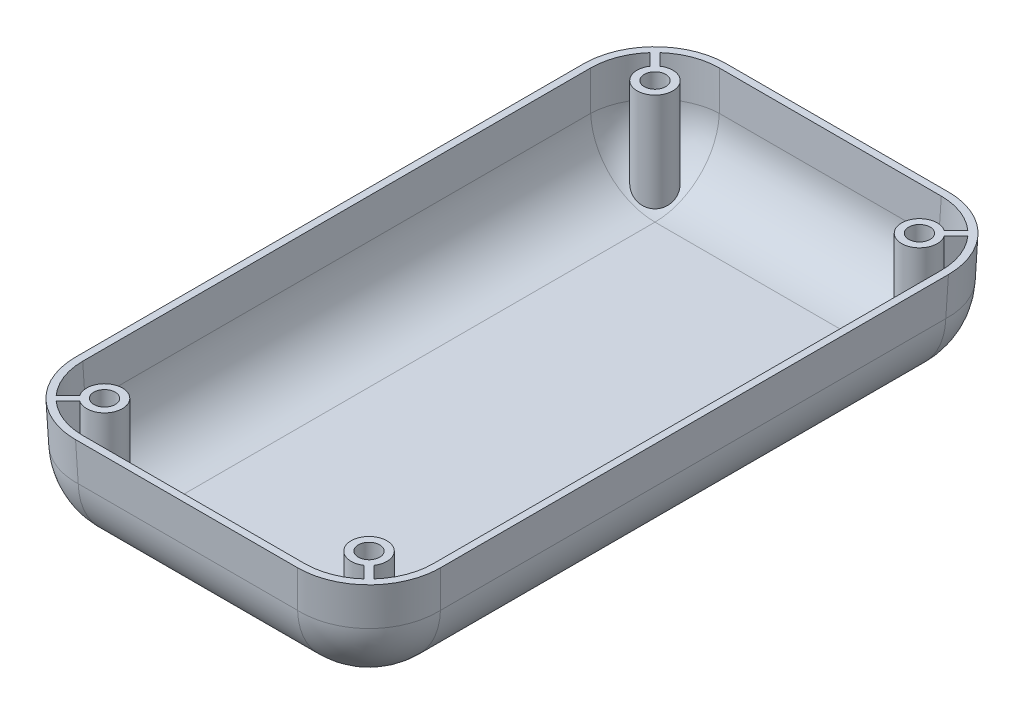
ISO-10303-21;
HEADER;
FILE_DESCRIPTION(('STEP AP214'),'2;1');
FILE_NAME('part.step','',(''),(''),'','','');
FILE_SCHEMA(('AUTOMOTIVE_DESIGN { 1 0 10303 214 1 1 1 1 }'));
ENDSEC;
DATA;
#1=APPLICATION_CONTEXT('core data for automotive mechanical design processes');
#2=APPLICATION_PROTOCOL_DEFINITION('international standard','automotive_design',2000,#1);
#3=PRODUCT_CONTEXT('',#1,'mechanical');
#4=PRODUCT('Part','Part','',(#3));
#5=PRODUCT_RELATED_PRODUCT_CATEGORY('part','',(#4));
#6=PRODUCT_DEFINITION_FORMATION('','',#4);
#7=PRODUCT_DEFINITION_CONTEXT('part definition',#1,'design');
#8=PRODUCT_DEFINITION('design','',#6,#7);
#9=PRODUCT_DEFINITION_SHAPE('','',#8);
#10=(LENGTH_UNIT() NAMED_UNIT(*) SI_UNIT(.MILLI.,.METRE.));
#11=(NAMED_UNIT(*) PLANE_ANGLE_UNIT() SI_UNIT($,.RADIAN.));
#12=(NAMED_UNIT(*) SI_UNIT($,.STERADIAN.) SOLID_ANGLE_UNIT());
#13=UNCERTAINTY_MEASURE_WITH_UNIT(LENGTH_MEASURE(1.E-05),#10,'distance_accuracy_value','');
#14=(GEOMETRIC_REPRESENTATION_CONTEXT(3) GLOBAL_UNCERTAINTY_ASSIGNED_CONTEXT((#13)) GLOBAL_UNIT_ASSIGNED_CONTEXT((#10,
#11,#12)) REPRESENTATION_CONTEXT('',''));
#15=CARTESIAN_POINT('',(0.,0.,0.));
#16=DIRECTION('',(0.,0.,1.));
#17=DIRECTION('',(1.,0.,0.));
#18=AXIS2_PLACEMENT_3D('',#15,#16,#17);
#19=CARTESIAN_POINT('',(-15.0182492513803,0.697140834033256,35.0182492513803));
#20=DIRECTION('',(0.0348782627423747,-0.998782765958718,-0.0348782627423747));
#21=DIRECTION('',(0.,0.034899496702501,-0.999390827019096));
#22=AXIS2_PLACEMENT_3D('',#19,#20,#21);
#23=CYLINDRICAL_SURFACE('',#22,9.);
#24=CARTESIAN_POINT('',(-15.3431122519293,10.,35.3431122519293));
#25=DIRECTION('',(0.0348782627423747,-0.998782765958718,-0.0348782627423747));
#26=DIRECTION('',(0.,0.034899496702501,-0.999390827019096));
#27=AXIS2_PLACEMENT_3D('',#24,#25,#26);
#28=CIRCLE('',#27,9.);
#29=CARTESIAN_POINT('',(-15.3431122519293,9.68590452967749,44.3376296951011));
#30=VERTEX_POINT('',#29);
#31=CARTESIAN_POINT('',(-21.3359569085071,9.55675779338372,42.0430636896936));
#32=VERTEX_POINT('',#31);
#33=EDGE_CURVE('E686',#30,#32,#28,.T.);
#34=ORIENTED_EDGE('',*,*,#33,.T.);
#35=DIRECTION('',(0.0348782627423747,-0.998782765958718,-0.0348782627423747));
#36=VECTOR('',#35,1.);
#37=CARTESIAN_POINT('',(-21.0110939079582,0.253898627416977,41.7182006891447));
#38=LINE('',#37,#36);
#39=CARTESIAN_POINT('',(-21.5260391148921,15.,42.2331458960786));
#40=VERTEX_POINT('',#39);
#41=EDGE_CURVE('E361',#40,#32,#38,.T.);
#42=ORIENTED_EDGE('',*,*,#41,.F.);
#43=CARTESIAN_POINT('',(-15.517716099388,15.,35.517716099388));
#44=DIRECTION('',(0.,1.,0.));
#45=DIRECTION('',(0.707106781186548,0.,-0.707106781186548));
#46=AXIS2_PLACEMENT_3D('',#43,#44,#45);
#47=ELLIPSE('',#46,9.01096845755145,9.);
#48=CARTESIAN_POINT('',(-15.5286845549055,15.,44.5232019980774));
#49=VERTEX_POINT('',#48);
#50=EDGE_CURVE('E350',#40,#49,#47,.T.);
#51=ORIENTED_EDGE('',*,*,#50,.T.);
#52=DIRECTION('',(0.0348782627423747,-0.998782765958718,-0.0348782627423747));
#53=VECTOR('',#52,1.);
#54=CARTESIAN_POINT('',(-15.0182492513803,0.383045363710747,44.0127666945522));
#55=LINE('',#54,#53);
#56=EDGE_CURVE('E672',#49,#30,#55,.T.);
#57=ORIENTED_EDGE('',*,*,#56,.T.);
#58=EDGE_LOOP('',(#34,#42,#51,#57));
#59=FACE_BOUND('',#58,.T.);
#60=ADVANCED_FACE('F93',(#59),#23,.F.);
#61=CARTESIAN_POINT('',(14.957424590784,-1.04464955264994,-34.957424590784));
#62=DIRECTION('',(-0.0348782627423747,-0.998782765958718,0.0348782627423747));
#63=DIRECTION('',(0.,-0.034899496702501,-0.999390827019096));
#64=AXIS2_PLACEMENT_3D('',#61,#62,#63);
#65=CYLINDRICAL_SURFACE('',#64,9.);
#66=CARTESIAN_POINT('',(15.3431122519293,10.,-35.3431122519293));
#67=DIRECTION('',(-0.0348782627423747,-0.998782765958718,0.0348782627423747));
#68=DIRECTION('',(0.,-0.034899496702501,-0.999390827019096));
#69=AXIS2_PLACEMENT_3D('',#66,#67,#68);
#70=CIRCLE('',#69,9.);
#71=CARTESIAN_POINT('',(15.3431122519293,9.68590452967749,-44.3376296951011));
#72=VERTEX_POINT('',#71);
#73=CARTESIAN_POINT('',(21.3359569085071,9.55675779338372,-42.0430636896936));
#74=VERTEX_POINT('',#73);
#75=EDGE_CURVE('E718',#72,#74,#70,.T.);
#76=ORIENTED_EDGE('',*,*,#75,.T.);
#77=DIRECTION('',(-0.0348782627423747,-0.998782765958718,0.0348782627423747));
#78=VECTOR('',#77,1.);
#79=CARTESIAN_POINT('',(20.9502692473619,-1.48789175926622,-41.6573760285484));
#80=LINE('',#79,#78);
#81=CARTESIAN_POINT('',(21.5260391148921,15.,-42.2331458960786));
#82=VERTEX_POINT('',#81);
#83=EDGE_CURVE('E905',#82,#74,#80,.T.);
#84=ORIENTED_EDGE('',*,*,#83,.F.);
#85=CARTESIAN_POINT('',(15.517716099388,15.,-35.517716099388));
#86=DIRECTION('',(0.,1.,0.));
#87=DIRECTION('',(-0.707106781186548,0.,0.707106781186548));
#88=AXIS2_PLACEMENT_3D('',#85,#86,#87);
#89=ELLIPSE('',#88,9.01096845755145,9.);
#90=CARTESIAN_POINT('',(15.5286845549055,15.,-44.5232019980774));
#91=VERTEX_POINT('',#90);
#92=EDGE_CURVE('E538',#82,#91,#89,.T.);
#93=ORIENTED_EDGE('',*,*,#92,.T.);
#94=DIRECTION('',(0.0348782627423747,0.998782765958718,-0.0348782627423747));
#95=VECTOR('',#94,1.);
#96=CARTESIAN_POINT('',(14.957424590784,-1.35874502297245,-43.9519420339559));
#97=LINE('',#96,#95);
#98=EDGE_CURVE('E534',#91,#72,#97,.F.);
#99=ORIENTED_EDGE('',*,*,#98,.T.);
#100=EDGE_LOOP('',(#76,#84,#93,#99));
#101=FACE_BOUND('',#100,.T.);
#102=ADVANCED_FACE('F488',(#101),#65,.F.);
#103=CARTESIAN_POINT('',(-15.0182492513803,0.697140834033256,-35.0182492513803));
#104=DIRECTION('',(0.0348782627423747,-0.998782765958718,0.0348782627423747));
#105=DIRECTION('',(0.,-0.034899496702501,-0.999390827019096));
#106=AXIS2_PLACEMENT_3D('',#103,#104,#105);
#107=CYLINDRICAL_SURFACE('',#106,9.);
#108=CARTESIAN_POINT('',(-15.3431122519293,10.,-35.3431122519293));
#109=DIRECTION('',(0.0348782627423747,-0.998782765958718,0.0348782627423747));
#110=DIRECTION('',(0.,-0.034899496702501,-0.999390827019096));
#111=AXIS2_PLACEMENT_3D('',#108,#109,#110);
#112=CIRCLE('',#111,9.);
#113=CARTESIAN_POINT('',(-24.3376296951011,9.6859045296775,-35.3431122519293));
#114=VERTEX_POINT('',#113);
#115=CARTESIAN_POINT('',(-22.0430636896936,9.55675779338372,-41.335956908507));
#116=VERTEX_POINT('',#115);
#117=EDGE_CURVE('E728',#114,#116,#112,.T.);
#118=ORIENTED_EDGE('',*,*,#117,.T.);
#119=DIRECTION('',(0.0348782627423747,-0.998782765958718,0.0348782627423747));
#120=VECTOR('',#119,1.);
#121=CARTESIAN_POINT('',(-21.7182006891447,0.253898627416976,-41.0110939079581));
#122=LINE('',#121,#120);
#123=CARTESIAN_POINT('',(-22.2331458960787,15.,-41.526039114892));
#124=VERTEX_POINT('',#123);
#125=EDGE_CURVE('E755',#124,#116,#122,.T.);
#126=ORIENTED_EDGE('',*,*,#125,.F.);
#127=CARTESIAN_POINT('',(-15.517716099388,15.,-35.517716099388));
#128=DIRECTION('',(0.,1.,0.));
#129=DIRECTION('',(0.707106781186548,0.,0.707106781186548));
#130=AXIS2_PLACEMENT_3D('',#127,#128,#129);
#131=ELLIPSE('',#130,9.01096845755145,9.);
#132=CARTESIAN_POINT('',(-24.5232019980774,15.,-35.5286845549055));
#133=VERTEX_POINT('',#132);
#134=EDGE_CURVE('E745',#124,#133,#131,.T.);
#135=ORIENTED_EDGE('',*,*,#134,.T.);
#136=DIRECTION('',(0.0348782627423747,-0.998782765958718,0.0348782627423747));
#137=VECTOR('',#136,1.);
#138=CARTESIAN_POINT('',(-24.0127666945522,0.383045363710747,-35.0182492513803));
#139=LINE('',#138,#137);
#140=EDGE_CURVE('E691',#133,#114,#139,.T.);
#141=ORIENTED_EDGE('',*,*,#140,.T.);
#142=EDGE_LOOP('',(#118,#126,#135,#141));
#143=FACE_BOUND('',#142,.T.);
#144=ADVANCED_FACE('F495',(#143),#107,.F.);
#145=CARTESIAN_POINT('',(14.908764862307,-2.4380818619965,34.908764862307));
#146=DIRECTION('',(-0.0348782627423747,-0.998782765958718,-0.0348782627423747));
#147=DIRECTION('',(0.,0.034899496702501,-0.999390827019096));
#148=AXIS2_PLACEMENT_3D('',#145,#146,#147);
#149=CYLINDRICAL_SURFACE('',#148,9.);
#150=CARTESIAN_POINT('',(15.3431122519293,10.,35.3431122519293));
#151=DIRECTION('',(-0.0348782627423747,-0.998782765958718,-0.0348782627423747));
#152=DIRECTION('',(0.,0.034899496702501,-0.999390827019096));
#153=AXIS2_PLACEMENT_3D('',#150,#151,#152);
#154=CIRCLE('',#153,9.);
#155=CARTESIAN_POINT('',(24.3376296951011,9.6859045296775,35.3431122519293));
#156=VERTEX_POINT('',#155);
#157=CARTESIAN_POINT('',(22.0430636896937,9.55675779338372,41.3359569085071));
#158=VERTEX_POINT('',#157);
#159=EDGE_CURVE('E676',#156,#158,#154,.T.);
#160=ORIENTED_EDGE('',*,*,#159,.T.);
#161=DIRECTION('',(-0.0348782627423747,-0.998782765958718,-0.0348782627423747));
#162=VECTOR('',#161,1.);
#163=CARTESIAN_POINT('',(21.6087163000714,-2.88132406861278,40.9016095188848));
#164=LINE('',#163,#162);
#165=CARTESIAN_POINT('',(22.2331458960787,15.,41.526039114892));
#166=VERTEX_POINT('',#165);
#167=EDGE_CURVE('E844',#166,#158,#164,.T.);
#168=ORIENTED_EDGE('',*,*,#167,.F.);
#169=CARTESIAN_POINT('',(15.517716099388,15.,35.517716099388));
#170=DIRECTION('',(0.,1.,0.));
#171=DIRECTION('',(-0.707106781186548,0.,-0.707106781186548));
#172=AXIS2_PLACEMENT_3D('',#169,#170,#171);
#173=ELLIPSE('',#172,9.01096845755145,9.);
#174=CARTESIAN_POINT('',(24.5232019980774,15.,35.5286845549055));
#175=VERTEX_POINT('',#174);
#176=EDGE_CURVE('E539',#166,#175,#173,.T.);
#177=ORIENTED_EDGE('',*,*,#176,.T.);
#178=DIRECTION('',(-0.0348782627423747,-0.998782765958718,-0.0348782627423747));
#179=VECTOR('',#178,1.);
#180=CARTESIAN_POINT('',(23.9032823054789,-2.75217733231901,34.908764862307));
#181=LINE('',#180,#179);
#182=EDGE_CURVE('E669',#175,#156,#181,.T.);
#183=ORIENTED_EDGE('',*,*,#182,.T.);
#184=EDGE_LOOP('',(#160,#168,#177,#183));
#185=FACE_BOUND('',#184,.T.);
#186=ADVANCED_FACE('F427',(#185),#149,.F.);
#187=CARTESIAN_POINT('',(25.,0.,-45.));
#188=DIRECTION('',(0.999390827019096,-0.034899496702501,0.));
#189=DIRECTION('',(0.0348994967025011,0.999390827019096,0.));
#190=AXIS2_PLACEMENT_3D('',#187,#188,#189);
#191=PLANE('',#190);
#192=DIRECTION('',(0.,0.,-1.));
#193=VECTOR('',#192,1.);
#194=CARTESIAN_POINT('',(25.3370205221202,9.65100503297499,-45.));
#195=LINE('',#194,#193);
#196=CARTESIAN_POINT('',(25.3370205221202,9.65100503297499,35.3431122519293));
#197=VERTEX_POINT('',#196);
#198=CARTESIAN_POINT('',(25.3370205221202,9.65100503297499,-35.3431122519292));
#199=VERTEX_POINT('',#198);
#200=EDGE_CURVE('E583',#197,#199,#195,.T.);
#201=ORIENTED_EDGE('',*,*,#200,.T.);
#202=DIRECTION('',(0.0348782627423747,0.998782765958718,-0.0348782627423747));
#203=VECTOR('',#202,1.);
#204=CARTESIAN_POINT('',(25.0121575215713,0.348145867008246,-35.0182492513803));
#205=LINE('',#204,#203);
#206=CARTESIAN_POINT('',(25.5238115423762,15.,-35.5299032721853));
#207=VERTEX_POINT('',#206);
#208=EDGE_CURVE('E585',#199,#207,#205,.T.);
#209=ORIENTED_EDGE('',*,*,#208,.T.);
#210=DIRECTION('',(0.,0.,1.));
#211=VECTOR('',#210,1.);
#212=CARTESIAN_POINT('',(25.5238115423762,15.,-45.));
#213=LINE('',#212,#211);
#214=CARTESIAN_POINT('',(25.5238115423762,15.,35.5299032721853));
#215=VERTEX_POINT('',#214);
#216=EDGE_CURVE('E540',#215,#207,#213,.F.);
#217=ORIENTED_EDGE('',*,*,#216,.F.);
#218=DIRECTION('',(0.0348782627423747,0.998782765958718,0.0348782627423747));
#219=VECTOR('',#218,1.);
#220=CARTESIAN_POINT('',(24.902673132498,-2.78707682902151,34.908764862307));
#221=LINE('',#220,#219);
#222=EDGE_CURVE('E581',#215,#197,#221,.F.);
#223=ORIENTED_EDGE('',*,*,#222,.T.);
#224=EDGE_LOOP('',(#201,#209,#217,#223));
#225=FACE_BOUND('',#224,.T.);
#226=ADVANCED_FACE('F423',(#225),#191,.T.);
#227=CARTESIAN_POINT('',(-25.,0.,-45.));
#228=DIRECTION('',(0.,-0.034899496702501,-0.999390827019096));
#229=DIRECTION('',(0.,0.999390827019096,-0.034899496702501));
#230=AXIS2_PLACEMENT_3D('',#227,#228,#229);
#231=PLANE('',#230);
#232=DIRECTION('',(-1.,0.,0.));
#233=VECTOR('',#232,1.);
#234=CARTESIAN_POINT('',(-25.,9.65100503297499,-45.3370205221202));
#235=LINE('',#234,#233);
#236=CARTESIAN_POINT('',(15.3431122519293,9.65100503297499,-45.3370205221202));
#237=VERTEX_POINT('',#236);
#238=CARTESIAN_POINT('',(-15.3431122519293,9.65100503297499,-45.3370205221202));
#239=VERTEX_POINT('',#238);
#240=EDGE_CURVE('E555',#237,#239,#235,.T.);
#241=ORIENTED_EDGE('',*,*,#240,.T.);
#242=DIRECTION('',(-0.0348782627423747,0.998782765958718,-0.0348782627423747));
#243=VECTOR('',#242,1.);
#244=CARTESIAN_POINT('',(-15.0182492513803,0.348145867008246,-45.0121575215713));
#245=LINE('',#244,#243);
#246=CARTESIAN_POINT('',(-15.5299032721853,15.,-45.5238115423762));
#247=VERTEX_POINT('',#246);
#248=EDGE_CURVE('E558',#239,#247,#245,.T.);
#249=ORIENTED_EDGE('',*,*,#248,.T.);
#250=DIRECTION('',(1.,0.,0.));
#251=VECTOR('',#250,1.);
#252=CARTESIAN_POINT('',(-25.,15.,-45.5238115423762));
#253=LINE('',#252,#251);
#254=CARTESIAN_POINT('',(15.5299032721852,15.,-45.5238115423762));
#255=VERTEX_POINT('',#254);
#256=EDGE_CURVE('E543',#255,#247,#253,.F.);
#257=ORIENTED_EDGE('',*,*,#256,.F.);
#258=DIRECTION('',(0.0348782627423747,0.998782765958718,-0.0348782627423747));
#259=VECTOR('',#258,1.);
#260=CARTESIAN_POINT('',(14.957424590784,-1.39364451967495,-44.951332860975));
#261=LINE('',#260,#259);
#262=EDGE_CURVE('E553',#255,#237,#261,.F.);
#263=ORIENTED_EDGE('',*,*,#262,.T.);
#264=EDGE_LOOP('',(#241,#249,#257,#263));
#265=FACE_BOUND('',#264,.T.);
#266=ADVANCED_FACE('F426',(#265),#231,.T.);
#267=CARTESIAN_POINT('',(-25.,0.,-45.));
#268=DIRECTION('',(-0.999390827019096,-0.034899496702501,0.));
#269=DIRECTION('',(0.0348994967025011,-0.999390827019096,0.));
#270=AXIS2_PLACEMENT_3D('',#267,#268,#269);
#271=PLANE('',#270);
#272=DIRECTION('',(0.,0.,1.));
#273=VECTOR('',#272,1.);
#274=CARTESIAN_POINT('',(-25.3370205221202,9.65100503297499,-45.));
#275=LINE('',#274,#273);
#276=CARTESIAN_POINT('',(-25.3370205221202,9.65100503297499,-35.3431122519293));
#277=VERTEX_POINT('',#276);
#278=CARTESIAN_POINT('',(-25.3370205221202,9.65100503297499,35.3431122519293));
#279=VERTEX_POINT('',#278);
#280=EDGE_CURVE('E571',#277,#279,#275,.T.);
#281=ORIENTED_EDGE('',*,*,#280,.T.);
#282=DIRECTION('',(-0.0348782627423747,0.998782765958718,0.0348782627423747));
#283=VECTOR('',#282,1.);
#284=CARTESIAN_POINT('',(-24.9026731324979,-2.78707682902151,34.908764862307));
#285=LINE('',#284,#283);
#286=CARTESIAN_POINT('',(-25.5238115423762,15.,35.5299032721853));
#287=VERTEX_POINT('',#286);
#288=EDGE_CURVE('E573',#279,#287,#285,.T.);
#289=ORIENTED_EDGE('',*,*,#288,.T.);
#290=DIRECTION('',(0.,0.,-1.));
#291=VECTOR('',#290,1.);
#292=CARTESIAN_POINT('',(-25.5238115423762,15.,-45.));
#293=LINE('',#292,#291);
#294=CARTESIAN_POINT('',(-25.5238115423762,15.,-35.5299032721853));
#295=VERTEX_POINT('',#294);
#296=EDGE_CURVE('E547',#295,#287,#293,.F.);
#297=ORIENTED_EDGE('',*,*,#296,.F.);
#298=DIRECTION('',(-0.0348782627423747,0.998782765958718,-0.0348782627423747));
#299=VECTOR('',#298,1.);
#300=CARTESIAN_POINT('',(-25.0121575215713,0.348145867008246,-35.0182492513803));
#301=LINE('',#300,#299);
#302=EDGE_CURVE('E569',#295,#277,#301,.F.);
#303=ORIENTED_EDGE('',*,*,#302,.T.);
#304=EDGE_LOOP('',(#281,#289,#297,#303));
#305=FACE_BOUND('',#304,.T.);
#306=ADVANCED_FACE('F431',(#305),#271,.T.);
#307=CARTESIAN_POINT('',(-25.,0.,45.));
#308=DIRECTION('',(0.,-0.034899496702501,0.999390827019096));
#309=DIRECTION('',(0.,-0.999390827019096,-0.034899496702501));
#310=AXIS2_PLACEMENT_3D('',#307,#308,#309);
#311=PLANE('',#310);
#312=DIRECTION('',(-1.,0.,0.));
#313=VECTOR('',#312,1.);
#314=CARTESIAN_POINT('',(-25.,15.,45.5238115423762));
#315=LINE('',#314,#313);
#316=CARTESIAN_POINT('',(-15.5299032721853,15.,45.5238115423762));
#317=VERTEX_POINT('',#316);
#318=CARTESIAN_POINT('',(15.5299032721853,15.,45.5238115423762));
#319=VERTEX_POINT('',#318);
#320=EDGE_CURVE('E550',#317,#319,#315,.F.);
#321=ORIENTED_EDGE('',*,*,#320,.F.);
#322=DIRECTION('',(-0.0348782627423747,0.998782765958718,0.0348782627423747));
#323=VECTOR('',#322,1.);
#324=CARTESIAN_POINT('',(-15.0182492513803,0.348145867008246,45.0121575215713));
#325=LINE('',#324,#323);
#326=CARTESIAN_POINT('',(-15.3431122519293,9.65100503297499,45.3370205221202));
#327=VERTEX_POINT('',#326);
#328=EDGE_CURVE('E579',#317,#327,#325,.F.);
#329=ORIENTED_EDGE('',*,*,#328,.T.);
#330=DIRECTION('',(1.,0.,0.));
#331=VECTOR('',#330,1.);
#332=CARTESIAN_POINT('',(-25.,9.65100503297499,45.3370205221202));
#333=LINE('',#332,#331);
#334=CARTESIAN_POINT('',(15.3431122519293,9.65100503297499,45.3370205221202));
#335=VERTEX_POINT('',#334);
#336=EDGE_CURVE('E577',#327,#335,#333,.T.);
#337=ORIENTED_EDGE('',*,*,#336,.T.);
#338=DIRECTION('',(0.0348782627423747,0.998782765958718,0.0348782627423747));
#339=VECTOR('',#338,1.);
#340=CARTESIAN_POINT('',(14.957424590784,-1.39364451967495,44.951332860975));
#341=LINE('',#340,#339);
#342=EDGE_CURVE('E575',#335,#319,#341,.T.);
#343=ORIENTED_EDGE('',*,*,#342,.T.);
#344=EDGE_LOOP('',(#321,#329,#337,#343));
#345=FACE_BOUND('',#344,.T.);
#346=ADVANCED_FACE('F419',(#345),#311,.T.);
#347=CARTESIAN_POINT('',(25.,15.,45.));
#348=DIRECTION('',(0.,1.,0.));
#349=DIRECTION('',(0.,0.,1.));
#350=AXIS2_PLACEMENT_3D('',#347,#348,#349);
#351=PLANE('',#350);
#352=DIRECTION('',(0.,0.,-1.));
#353=VECTOR('',#352,1.);
#354=CARTESIAN_POINT('',(-24.5232019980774,15.,-45.));
#355=LINE('',#354,#353);
#356=CARTESIAN_POINT('',(-24.5232019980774,15.,35.5286845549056));
#357=VERTEX_POINT('',#356);
#358=EDGE_CURVE('E529',#133,#357,#355,.F.);
#359=ORIENTED_EDGE('',*,*,#358,.F.);
#360=ORIENTED_EDGE('',*,*,#134,.F.);
#361=DIRECTION('',(0.707106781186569,0.,0.707106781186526));
#362=VECTOR('',#361,1.);
#363=CARTESIAN_POINT('',(-20.5856041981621,15.,-39.8784974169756));
#364=LINE('',#363,#362);
#365=CARTESIAN_POINT('',(-20.5856041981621,15.,-39.8784974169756));
#366=VERTEX_POINT('',#365);
#367=EDGE_CURVE('E795',#124,#366,#364,.T.);
#368=ORIENTED_EDGE('',*,*,#367,.T.);
#369=CARTESIAN_POINT('',(-18.5,15.,-38.5));
#370=DIRECTION('',(0.,1.,0.));
#371=DIRECTION('',(0.,0.,1.));
#372=AXIS2_PLACEMENT_3D('',#369,#370,#371);
#373=CIRCLE('',#372,2.5);
#374=CARTESIAN_POINT('',(-19.8784974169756,15.,-40.5856041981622));
#375=VERTEX_POINT('',#374);
#376=EDGE_CURVE('E788',#366,#375,#373,.T.);
#377=ORIENTED_EDGE('',*,*,#376,.T.);
#378=DIRECTION('',(-0.707106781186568,0.,-0.707106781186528));
#379=VECTOR('',#378,1.);
#380=CARTESIAN_POINT('',(-19.8784974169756,15.,-40.5856041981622));
#381=LINE('',#380,#379);
#382=CARTESIAN_POINT('',(-21.5260391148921,15.,-42.2331458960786));
#383=VERTEX_POINT('',#382);
#384=EDGE_CURVE('E786',#375,#383,#381,.T.);
#385=ORIENTED_EDGE('',*,*,#384,.T.);
#386=CARTESIAN_POINT('',(-15.5286845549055,15.,-44.5232019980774));
#387=VERTEX_POINT('',#386);
#388=EDGE_CURVE('E526',#387,#383,#131,.T.);
#389=ORIENTED_EDGE('',*,*,#388,.F.);
#390=DIRECTION('',(1.,0.,0.));
#391=VECTOR('',#390,1.);
#392=CARTESIAN_POINT('',(-25.,15.,-44.5232019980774));
#393=LINE('',#392,#391);
#394=EDGE_CURVE('E741',#91,#387,#393,.F.);
#395=ORIENTED_EDGE('',*,*,#394,.F.);
#396=ORIENTED_EDGE('',*,*,#92,.F.);
#397=DIRECTION('',(-0.707106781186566,0.,0.707106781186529));
#398=VECTOR('',#397,1.);
#399=CARTESIAN_POINT('',(19.8784974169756,15.,-40.5856041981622));
#400=LINE('',#399,#398);
#401=CARTESIAN_POINT('',(19.8784974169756,15.,-40.5856041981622));
#402=VERTEX_POINT('',#401);
#403=EDGE_CURVE('E894',#82,#402,#400,.T.);
#404=ORIENTED_EDGE('',*,*,#403,.T.);
#405=CARTESIAN_POINT('',(18.5,15.,-38.5));
#406=DIRECTION('',(0.,1.,0.));
#407=DIRECTION('',(0.,0.,-1.));
#408=AXIS2_PLACEMENT_3D('',#405,#406,#407);
#409=CIRCLE('',#408,2.5);
#410=CARTESIAN_POINT('',(20.5856041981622,15.,-39.8784974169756));
#411=VERTEX_POINT('',#410);
#412=EDGE_CURVE('E892',#402,#411,#409,.T.);
#413=ORIENTED_EDGE('',*,*,#412,.T.);
#414=DIRECTION('',(0.707106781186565,0.,-0.70710678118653));
#415=VECTOR('',#414,1.);
#416=CARTESIAN_POINT('',(20.5856041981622,15.,-39.8784974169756));
#417=LINE('',#416,#415);
#418=CARTESIAN_POINT('',(22.2331458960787,15.,-41.526039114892));
#419=VERTEX_POINT('',#418);
#420=EDGE_CURVE('E866',#411,#419,#417,.T.);
#421=ORIENTED_EDGE('',*,*,#420,.T.);
#422=CARTESIAN_POINT('',(24.5232019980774,15.,-35.5286845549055));
#423=VERTEX_POINT('',#422);
#424=EDGE_CURVE('E742',#423,#419,#89,.T.);
#425=ORIENTED_EDGE('',*,*,#424,.F.);
#426=DIRECTION('',(0.,0.,1.));
#427=VECTOR('',#426,1.);
#428=CARTESIAN_POINT('',(24.5232019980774,15.,-45.));
#429=LINE('',#428,#427);
#430=EDGE_CURVE('E713',#175,#423,#429,.F.);
#431=ORIENTED_EDGE('',*,*,#430,.F.);
#432=ORIENTED_EDGE('',*,*,#176,.F.);
#433=DIRECTION('',(-0.707106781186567,0.,-0.707106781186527));
#434=VECTOR('',#433,1.);
#435=CARTESIAN_POINT('',(20.5856041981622,15.,39.8784974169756));
#436=LINE('',#435,#434);
#437=CARTESIAN_POINT('',(20.5856041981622,15.,39.8784974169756));
#438=VERTEX_POINT('',#437);
#439=EDGE_CURVE('E837',#166,#438,#436,.T.);
#440=ORIENTED_EDGE('',*,*,#439,.T.);
#441=CARTESIAN_POINT('',(18.5,15.,38.5));
#442=DIRECTION('',(0.,1.,0.));
#443=DIRECTION('',(0.,0.,1.));
#444=AXIS2_PLACEMENT_3D('',#441,#442,#443);
#445=CIRCLE('',#444,2.5);
#446=CARTESIAN_POINT('',(19.8784974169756,15.,40.5856041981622));
#447=VERTEX_POINT('',#446);
#448=EDGE_CURVE('E830',#438,#447,#445,.T.);
#449=ORIENTED_EDGE('',*,*,#448,.T.);
#450=DIRECTION('',(0.707106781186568,0.,0.707106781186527));
#451=VECTOR('',#450,1.);
#452=CARTESIAN_POINT('',(19.8784974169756,15.,40.5856041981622));
#453=LINE('',#452,#451);
#454=CARTESIAN_POINT('',(21.5260391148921,15.,42.2331458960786));
#455=VERTEX_POINT('',#454);
#456=EDGE_CURVE('E832',#447,#455,#453,.T.);
#457=ORIENTED_EDGE('',*,*,#456,.T.);
#458=CARTESIAN_POINT('',(15.5286845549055,15.,44.5232019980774));
#459=VERTEX_POINT('',#458);
#460=EDGE_CURVE('E535',#459,#455,#173,.T.);
#461=ORIENTED_EDGE('',*,*,#460,.F.);
#462=DIRECTION('',(-1.,0.,0.));
#463=VECTOR('',#462,1.);
#464=CARTESIAN_POINT('',(-25.,15.,44.5232019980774));
#465=LINE('',#464,#463);
#466=EDGE_CURVE('E531',#49,#459,#465,.F.);
#467=ORIENTED_EDGE('',*,*,#466,.F.);
#468=ORIENTED_EDGE('',*,*,#50,.F.);
#469=DIRECTION('',(0.70710678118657,0.,-0.707106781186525));
#470=VECTOR('',#469,1.);
#471=CARTESIAN_POINT('',(-19.8784974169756,15.,40.5856041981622));
#472=LINE('',#471,#470);
#473=CARTESIAN_POINT('',(-19.8784974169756,15.,40.5856041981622));
#474=VERTEX_POINT('',#473);
#475=EDGE_CURVE('E332',#40,#474,#472,.T.);
#476=ORIENTED_EDGE('',*,*,#475,.T.);
#477=CARTESIAN_POINT('',(-18.5,15.,38.5));
#478=DIRECTION('',(0.,1.,0.));
#479=DIRECTION('',(0.,0.,-1.));
#480=AXIS2_PLACEMENT_3D('',#477,#478,#479);
#481=CIRCLE('',#480,2.50000000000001);
#482=CARTESIAN_POINT('',(-20.5856041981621,15.,39.8784974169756));
#483=VERTEX_POINT('',#482);
#484=EDGE_CURVE('E348',#474,#483,#481,.T.);
#485=ORIENTED_EDGE('',*,*,#484,.T.);
#486=DIRECTION('',(-0.707106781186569,0.,0.707106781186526));
#487=VECTOR('',#486,1.);
#488=CARTESIAN_POINT('',(-20.5856041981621,15.,39.8784974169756));
#489=LINE('',#488,#487);
#490=CARTESIAN_POINT('',(-22.2331458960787,15.,41.526039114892));
#491=VERTEX_POINT('',#490);
#492=EDGE_CURVE('E354',#483,#491,#489,.T.);
#493=ORIENTED_EDGE('',*,*,#492,.T.);
#494=EDGE_CURVE('E517',#357,#491,#47,.T.);
#495=ORIENTED_EDGE('',*,*,#494,.F.);
#496=EDGE_LOOP('',(#359,#360,#368,#377,#385,#389,#395,#396,#404,#413,#421,#425,#431,#432,#440,
#449,#457,#461,#467,#468,#476,#485,#493,#495));
#497=FACE_BOUND('',#496,.T.);
#498=ORIENTED_EDGE('',*,*,#296,.T.);
#499=CARTESIAN_POINT('',(-15.517716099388,15.,35.517716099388));
#500=DIRECTION('',(0.,1.,0.));
#501=DIRECTION('',(0.707106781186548,0.,-0.707106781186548));
#502=AXIS2_PLACEMENT_3D('',#499,#500,#501);
#503=ELLIPSE('',#502,10.0121871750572,10.);
#504=EDGE_CURVE('E593',#287,#317,#503,.T.);
#505=ORIENTED_EDGE('',*,*,#504,.T.);
#506=ORIENTED_EDGE('',*,*,#320,.T.);
#507=CARTESIAN_POINT('',(15.517716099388,15.,35.517716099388));
#508=DIRECTION('',(0.,1.,0.));
#509=DIRECTION('',(-0.707106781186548,0.,-0.707106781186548));
#510=AXIS2_PLACEMENT_3D('',#507,#508,#509);
#511=ELLIPSE('',#510,10.0121871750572,10.);
#512=EDGE_CURVE('E587',#319,#215,#511,.T.);
#513=ORIENTED_EDGE('',*,*,#512,.T.);
#514=ORIENTED_EDGE('',*,*,#216,.T.);
#515=CARTESIAN_POINT('',(15.517716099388,15.,-35.517716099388));
#516=DIRECTION('',(0.,1.,0.));
#517=DIRECTION('',(-0.707106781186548,0.,0.707106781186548));
#518=AXIS2_PLACEMENT_3D('',#515,#516,#517);
#519=ELLIPSE('',#518,10.0121871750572,10.);
#520=EDGE_CURVE('E589',#207,#255,#519,.T.);
#521=ORIENTED_EDGE('',*,*,#520,.T.);
#522=ORIENTED_EDGE('',*,*,#256,.T.);
#523=CARTESIAN_POINT('',(-15.517716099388,15.,-35.517716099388));
#524=DIRECTION('',(0.,1.,0.));
#525=DIRECTION('',(0.707106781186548,0.,0.707106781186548));
#526=AXIS2_PLACEMENT_3D('',#523,#524,#525);
#527=ELLIPSE('',#526,10.0121871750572,10.);
#528=EDGE_CURVE('E591',#247,#295,#527,.T.);
#529=ORIENTED_EDGE('',*,*,#528,.T.);
#530=EDGE_LOOP('',(#498,#505,#506,#513,#514,#521,#522,#529));
#531=FACE_BOUND('',#530,.T.);
#532=CARTESIAN_POINT('',(18.5,15.,38.5));
#533=DIRECTION('',(0.,1.,0.));
#534=DIRECTION('',(0.,0.,1.));
#535=AXIS2_PLACEMENT_3D('',#532,#533,#534);
#536=CIRCLE('',#535,1.5);
#537=CARTESIAN_POINT('',(18.5,15.,40.));
#538=VERTEX_POINT('',#537);
#539=EDGE_CURVE('E841',#538,#538,#536,.T.);
#540=ORIENTED_EDGE('',*,*,#539,.F.);
#541=EDGE_LOOP('',(#540));
#542=FACE_BOUND('',#541,.T.);
#543=CARTESIAN_POINT('',(-18.5,15.,-38.5));
#544=DIRECTION('',(0.,1.,0.));
#545=DIRECTION('',(0.,0.,1.));
#546=AXIS2_PLACEMENT_3D('',#543,#544,#545);
#547=CIRCLE('',#546,1.5);
#548=CARTESIAN_POINT('',(-18.5,15.,-37.));
#549=VERTEX_POINT('',#548);
#550=EDGE_CURVE('E790',#549,#549,#547,.T.);
#551=ORIENTED_EDGE('',*,*,#550,.F.);
#552=EDGE_LOOP('',(#551));
#553=FACE_BOUND('',#552,.T.);
#554=CARTESIAN_POINT('',(18.5,15.,-38.5));
#555=DIRECTION('',(0.,1.,0.));
#556=DIRECTION('',(0.,0.,-1.));
#557=AXIS2_PLACEMENT_3D('',#554,#555,#556);
#558=CIRCLE('',#557,1.5);
#559=CARTESIAN_POINT('',(18.5,15.,-40.));
#560=VERTEX_POINT('',#559);
#561=EDGE_CURVE('E897',#560,#560,#558,.T.);
#562=ORIENTED_EDGE('',*,*,#561,.F.);
#563=EDGE_LOOP('',(#562));
#564=FACE_BOUND('',#563,.T.);
#565=CARTESIAN_POINT('',(-18.5,15.,38.5));
#566=DIRECTION('',(0.,1.,0.));
#567=DIRECTION('',(0.,0.,-1.));
#568=AXIS2_PLACEMENT_3D('',#565,#566,#567);
#569=CIRCLE('',#568,1.5);
#570=CARTESIAN_POINT('',(-18.5,15.,37.));
#571=VERTEX_POINT('',#570);
#572=EDGE_CURVE('E351',#571,#571,#569,.T.);
#573=ORIENTED_EDGE('',*,*,#572,.F.);
#574=EDGE_LOOP('',(#573));
#575=FACE_BOUND('',#574,.T.);
#576=ADVANCED_FACE('F345',(#497,#531,#542,#553,#564,#575),#351,.T.);
#577=CARTESIAN_POINT('',(25.,0.,45.));
#578=DIRECTION('',(0.,1.,0.));
#579=DIRECTION('',(0.,0.,1.));
#580=AXIS2_PLACEMENT_3D('',#577,#578,#579);
#581=PLANE('',#580);
#582=DIRECTION('',(0.,0.,-1.));
#583=VECTOR('',#582,1.);
#584=CARTESIAN_POINT('',(-15.3431122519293,0.,45.));
#585=LINE('',#584,#583);
#586=CARTESIAN_POINT('',(-15.3431122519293,0.,35.3431122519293));
#587=VERTEX_POINT('',#586);
#588=CARTESIAN_POINT('',(-15.3431122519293,0.,-35.3431122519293));
#589=VERTEX_POINT('',#588);
#590=EDGE_CURVE('E564',#587,#589,#585,.T.);
#591=ORIENTED_EDGE('',*,*,#590,.T.);
#592=DIRECTION('',(1.,0.,0.));
#593=VECTOR('',#592,1.);
#594=CARTESIAN_POINT('',(25.,0.,-35.3431122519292));
#595=LINE('',#594,#593);
#596=CARTESIAN_POINT('',(15.3431122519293,0.,-35.3431122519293));
#597=VERTEX_POINT('',#596);
#598=EDGE_CURVE('E566',#589,#597,#595,.T.);
#599=ORIENTED_EDGE('',*,*,#598,.T.);
#600=DIRECTION('',(0.,0.,1.));
#601=VECTOR('',#600,1.);
#602=CARTESIAN_POINT('',(15.3431122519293,0.,45.));
#603=LINE('',#602,#601);
#604=CARTESIAN_POINT('',(15.3431122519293,0.,35.3431122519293));
#605=VERTEX_POINT('',#604);
#606=EDGE_CURVE('E560',#597,#605,#603,.T.);
#607=ORIENTED_EDGE('',*,*,#606,.T.);
#608=DIRECTION('',(-1.,0.,0.));
#609=VECTOR('',#608,1.);
#610=CARTESIAN_POINT('',(25.,0.,35.3431122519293));
#611=LINE('',#610,#609);
#612=EDGE_CURVE('E562',#605,#587,#611,.T.);
#613=ORIENTED_EDGE('',*,*,#612,.T.);
#614=EDGE_LOOP('',(#591,#599,#607,#613));
#615=FACE_BOUND('',#614,.T.);
#616=ADVANCED_FACE('F418',(#615),#581,.F.);
#617=CARTESIAN_POINT('',(14.908764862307,-2.4380818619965,34.908764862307));
#618=DIRECTION('',(-0.0348782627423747,-0.998782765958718,-0.0348782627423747));
#619=DIRECTION('',(0.,0.034899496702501,-0.999390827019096));
#620=AXIS2_PLACEMENT_3D('',#617,#618,#619);
#621=CYLINDRICAL_SURFACE('',#620,10.);
#622=ORIENTED_EDGE('',*,*,#512,.F.);
#623=ORIENTED_EDGE('',*,*,#342,.F.);
#624=CARTESIAN_POINT('',(15.3431122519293,10.,35.3431122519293));
#625=DIRECTION('',(-0.0348782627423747,-0.998782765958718,-0.0348782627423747));
#626=DIRECTION('',(0.,0.0348994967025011,-0.999390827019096));
#627=AXIS2_PLACEMENT_3D('',#624,#625,#626);
#628=CIRCLE('',#627,10.);
#629=EDGE_CURVE('E621',#197,#335,#628,.T.);
#630=ORIENTED_EDGE('',*,*,#629,.F.);
#631=ORIENTED_EDGE('',*,*,#222,.F.);
#632=EDGE_LOOP('',(#622,#623,#630,#631));
#633=FACE_BOUND('',#632,.T.);
#634=ADVANCED_FACE('F95',(#633),#621,.T.);
#635=CARTESIAN_POINT('',(-15.0182492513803,0.697140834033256,35.0182492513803));
#636=DIRECTION('',(0.0348782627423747,-0.998782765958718,-0.0348782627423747));
#637=DIRECTION('',(0.,0.034899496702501,-0.999390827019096));
#638=AXIS2_PLACEMENT_3D('',#635,#636,#637);
#639=CYLINDRICAL_SURFACE('',#638,10.);
#640=ORIENTED_EDGE('',*,*,#504,.F.);
#641=ORIENTED_EDGE('',*,*,#288,.F.);
#642=CARTESIAN_POINT('',(-15.3431122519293,10.,35.3431122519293));
#643=DIRECTION('',(0.0348782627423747,-0.998782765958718,-0.0348782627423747));
#644=DIRECTION('',(0.,0.034899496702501,-0.999390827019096));
#645=AXIS2_PLACEMENT_3D('',#642,#643,#644);
#646=CIRCLE('',#645,10.);
#647=EDGE_CURVE('E618',#327,#279,#646,.T.);
#648=ORIENTED_EDGE('',*,*,#647,.F.);
#649=ORIENTED_EDGE('',*,*,#328,.F.);
#650=EDGE_LOOP('',(#640,#641,#648,#649));
#651=FACE_BOUND('',#650,.T.);
#652=ADVANCED_FACE('F478',(#651),#639,.T.);
#653=CARTESIAN_POINT('',(-25.,10.,35.3431122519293));
#654=DIRECTION('',(-1.,0.,0.));
#655=DIRECTION('',(0.,0.,1.));
#656=AXIS2_PLACEMENT_3D('',#653,#654,#655);
#657=CYLINDRICAL_SURFACE('',#656,10.);
#658=CARTESIAN_POINT('',(15.3431122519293,10.,35.3431122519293));
#659=DIRECTION('',(1.,0.,0.));
#660=DIRECTION('',(0.,1.,0.));
#661=AXIS2_PLACEMENT_3D('',#658,#659,#660);
#662=CIRCLE('',#661,10.);
#663=EDGE_CURVE('E544',#335,#605,#662,.T.);
#664=ORIENTED_EDGE('',*,*,#663,.F.);
#665=ORIENTED_EDGE('',*,*,#336,.F.);
#666=CARTESIAN_POINT('',(-15.3431122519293,10.,35.3431122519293));
#667=DIRECTION('',(-1.,0.,0.));
#668=DIRECTION('',(0.,0.,1.));
#669=AXIS2_PLACEMENT_3D('',#666,#667,#668);
#670=CIRCLE('',#669,10.);
#671=EDGE_CURVE('E615',#587,#327,#670,.T.);
#672=ORIENTED_EDGE('',*,*,#671,.F.);
#673=ORIENTED_EDGE('',*,*,#612,.F.);
#674=EDGE_LOOP('',(#664,#665,#672,#673));
#675=FACE_BOUND('',#674,.T.);
#676=ADVANCED_FACE('F475',(#675),#657,.T.);
#677=CARTESIAN_POINT('',(15.3431122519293,10.,35.3431122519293));
#678=DIRECTION('',(0.,0.,1.));
#679=DIRECTION('',(1.,0.,0.));
#680=AXIS2_PLACEMENT_3D('',#677,#678,#679);
#681=SPHERICAL_SURFACE('',#680,10.);
#682=ORIENTED_EDGE('',*,*,#629,.T.);
#683=ORIENTED_EDGE('',*,*,#663,.T.);
#684=CARTESIAN_POINT('',(15.3431122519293,10.,35.3431122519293));
#685=DIRECTION('',(0.,0.,1.));
#686=DIRECTION('',(1.,0.,0.));
#687=AXIS2_PLACEMENT_3D('',#684,#685,#686);
#688=CIRCLE('',#687,10.);
#689=EDGE_CURVE('E612',#197,#605,#688,.F.);
#690=ORIENTED_EDGE('',*,*,#689,.F.);
#691=EDGE_LOOP('',(#682,#683,#690));
#692=FACE_BOUND('',#691,.T.);
#693=ADVANCED_FACE('F471',(#692),#681,.T.);
#694=CARTESIAN_POINT('',(-15.3431122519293,10.,35.3431122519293));
#695=DIRECTION('',(0.,0.,1.));
#696=DIRECTION('',(1.,0.,0.));
#697=AXIS2_PLACEMENT_3D('',#694,#695,#696);
#698=SPHERICAL_SURFACE('',#697,10.);
#699=ORIENTED_EDGE('',*,*,#671,.T.);
#700=ORIENTED_EDGE('',*,*,#647,.T.);
#701=CARTESIAN_POINT('',(-15.3431122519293,10.,35.3431122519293));
#702=DIRECTION('',(0.,0.,1.));
#703=DIRECTION('',(1.,0.,0.));
#704=AXIS2_PLACEMENT_3D('',#701,#702,#703);
#705=CIRCLE('',#704,10.);
#706=EDGE_CURVE('E609',#587,#279,#705,.F.);
#707=ORIENTED_EDGE('',*,*,#706,.F.);
#708=EDGE_LOOP('',(#699,#700,#707));
#709=FACE_BOUND('',#708,.T.);
#710=ADVANCED_FACE('F467',(#709),#698,.T.);
#711=CARTESIAN_POINT('',(15.3431122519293,10.,-45.));
#712=DIRECTION('',(0.,0.,1.));
#713=DIRECTION('',(1.,0.,0.));
#714=AXIS2_PLACEMENT_3D('',#711,#712,#713);
#715=CYLINDRICAL_SURFACE('',#714,10.);
#716=ORIENTED_EDGE('',*,*,#689,.T.);
#717=ORIENTED_EDGE('',*,*,#606,.F.);
#718=CARTESIAN_POINT('',(15.3431122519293,10.,-35.3431122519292));
#719=DIRECTION('',(0.,0.,-1.));
#720=DIRECTION('',(0.,1.,0.));
#721=AXIS2_PLACEMENT_3D('',#718,#719,#720);
#722=CIRCLE('',#721,10.);
#723=EDGE_CURVE('E606',#199,#597,#722,.T.);
#724=ORIENTED_EDGE('',*,*,#723,.F.);
#725=ORIENTED_EDGE('',*,*,#200,.F.);
#726=EDGE_LOOP('',(#716,#717,#724,#725));
#727=FACE_BOUND('',#726,.T.);
#728=ADVANCED_FACE('F463',(#727),#715,.T.);
#729=CARTESIAN_POINT('',(14.957424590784,-1.04464955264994,-34.957424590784));
#730=DIRECTION('',(-0.0348782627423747,-0.998782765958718,0.0348782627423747));
#731=DIRECTION('',(0.,-0.034899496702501,-0.999390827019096));
#732=AXIS2_PLACEMENT_3D('',#729,#730,#731);
#733=CYLINDRICAL_SURFACE('',#732,10.);
#734=ORIENTED_EDGE('',*,*,#520,.F.);
#735=ORIENTED_EDGE('',*,*,#208,.F.);
#736=CARTESIAN_POINT('',(15.3431122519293,10.,-35.3431122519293));
#737=DIRECTION('',(-0.0348782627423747,-0.998782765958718,0.0348782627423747));
#738=DIRECTION('',(0.999390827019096,-0.0348994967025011,0.));
#739=AXIS2_PLACEMENT_3D('',#736,#737,#738);
#740=CIRCLE('',#739,10.);
#741=EDGE_CURVE('E603',#237,#199,#740,.T.);
#742=ORIENTED_EDGE('',*,*,#741,.F.);
#743=ORIENTED_EDGE('',*,*,#262,.F.);
#744=EDGE_LOOP('',(#734,#735,#742,#743));
#745=FACE_BOUND('',#744,.T.);
#746=ADVANCED_FACE('F459',(#745),#733,.T.);
#747=CARTESIAN_POINT('',(-15.0182492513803,0.697140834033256,-35.0182492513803));
#748=DIRECTION('',(0.0348782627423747,-0.998782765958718,0.0348782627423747));
#749=DIRECTION('',(0.,-0.034899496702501,-0.999390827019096));
#750=AXIS2_PLACEMENT_3D('',#747,#748,#749);
#751=CYLINDRICAL_SURFACE('',#750,10.);
#752=ORIENTED_EDGE('',*,*,#528,.F.);
#753=ORIENTED_EDGE('',*,*,#248,.F.);
#754=CARTESIAN_POINT('',(-15.3431122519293,10.,-35.3431122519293));
#755=DIRECTION('',(0.0348782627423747,-0.998782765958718,0.0348782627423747));
#756=DIRECTION('',(0.,-0.034899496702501,-0.999390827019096));
#757=AXIS2_PLACEMENT_3D('',#754,#755,#756);
#758=CIRCLE('',#757,10.);
#759=EDGE_CURVE('E600',#277,#239,#758,.T.);
#760=ORIENTED_EDGE('',*,*,#759,.F.);
#761=ORIENTED_EDGE('',*,*,#302,.F.);
#762=EDGE_LOOP('',(#752,#753,#760,#761));
#763=FACE_BOUND('',#762,.T.);
#764=ADVANCED_FACE('F455',(#763),#751,.T.);
#765=CARTESIAN_POINT('',(-15.3431122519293,10.,-45.));
#766=DIRECTION('',(0.,0.,-1.));
#767=DIRECTION('',(-1.,0.,0.));
#768=AXIS2_PLACEMENT_3D('',#765,#766,#767);
#769=CYLINDRICAL_SURFACE('',#768,10.);
#770=ORIENTED_EDGE('',*,*,#706,.T.);
#771=ORIENTED_EDGE('',*,*,#280,.F.);
#772=CARTESIAN_POINT('',(-15.3431122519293,10.,-35.3431122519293));
#773=DIRECTION('',(0.,0.,-1.));
#774=DIRECTION('',(-1.,0.,0.));
#775=AXIS2_PLACEMENT_3D('',#772,#773,#774);
#776=CIRCLE('',#775,10.);
#777=EDGE_CURVE('E597',#589,#277,#776,.T.);
#778=ORIENTED_EDGE('',*,*,#777,.F.);
#779=ORIENTED_EDGE('',*,*,#590,.F.);
#780=EDGE_LOOP('',(#770,#771,#778,#779));
#781=FACE_BOUND('',#780,.T.);
#782=ADVANCED_FACE('F451',(#781),#769,.T.);
#783=CARTESIAN_POINT('',(15.3431122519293,10.,-35.3431122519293));
#784=DIRECTION('',(0.,0.,1.));
#785=DIRECTION('',(1.,0.,0.));
#786=AXIS2_PLACEMENT_3D('',#783,#784,#785);
#787=SPHERICAL_SURFACE('',#786,10.);
#788=ORIENTED_EDGE('',*,*,#741,.T.);
#789=ORIENTED_EDGE('',*,*,#723,.T.);
#790=CARTESIAN_POINT('',(15.3431122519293,10.,-35.3431122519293));
#791=DIRECTION('',(1.,0.,0.));
#792=DIRECTION('',(0.,0.,-1.));
#793=AXIS2_PLACEMENT_3D('',#790,#791,#792);
#794=CIRCLE('',#793,10.);
#795=EDGE_CURVE('E524',#237,#597,#794,.F.);
#796=ORIENTED_EDGE('',*,*,#795,.F.);
#797=EDGE_LOOP('',(#788,#789,#796));
#798=FACE_BOUND('',#797,.T.);
#799=ADVANCED_FACE('F447',(#798),#787,.T.);
#800=CARTESIAN_POINT('',(-15.3431122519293,10.,-35.3431122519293));
#801=DIRECTION('',(0.,0.,1.));
#802=DIRECTION('',(1.,0.,0.));
#803=AXIS2_PLACEMENT_3D('',#800,#801,#802);
#804=SPHERICAL_SURFACE('',#803,10.);
#805=ORIENTED_EDGE('',*,*,#777,.T.);
#806=ORIENTED_EDGE('',*,*,#759,.T.);
#807=CARTESIAN_POINT('',(-15.3431122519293,10.,-35.3431122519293));
#808=DIRECTION('',(-1.,0.,0.));
#809=DIRECTION('',(0.,0.,1.));
#810=AXIS2_PLACEMENT_3D('',#807,#808,#809);
#811=CIRCLE('',#810,10.);
#812=EDGE_CURVE('E522',#589,#239,#811,.F.);
#813=ORIENTED_EDGE('',*,*,#812,.F.);
#814=EDGE_LOOP('',(#805,#806,#813));
#815=FACE_BOUND('',#814,.T.);
#816=ADVANCED_FACE('F443',(#815),#804,.T.);
#817=CARTESIAN_POINT('',(-25.,10.,-35.3431122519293));
#818=DIRECTION('',(1.,0.,0.));
#819=DIRECTION('',(0.,0.,-1.));
#820=AXIS2_PLACEMENT_3D('',#817,#818,#819);
#821=CYLINDRICAL_SURFACE('',#820,10.);
#822=ORIENTED_EDGE('',*,*,#795,.T.);
#823=ORIENTED_EDGE('',*,*,#598,.F.);
#824=ORIENTED_EDGE('',*,*,#812,.T.);
#825=ORIENTED_EDGE('',*,*,#240,.F.);
#826=EDGE_LOOP('',(#822,#823,#824,#825));
#827=FACE_BOUND('',#826,.T.);
#828=ADVANCED_FACE('F439',(#827),#821,.T.);
#829=CARTESIAN_POINT('',(24.0006091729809,0.034899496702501,-45.));
#830=DIRECTION('',(0.999390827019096,-0.034899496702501,0.));
#831=DIRECTION('',(0.0348994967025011,0.999390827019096,0.));
#832=AXIS2_PLACEMENT_3D('',#829,#830,#831);
#833=PLANE('',#832);
#834=DIRECTION('',(0.,0.,1.));
#835=VECTOR('',#834,1.);
#836=CARTESIAN_POINT('',(24.3376296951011,9.6859045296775,-45.));
#837=LINE('',#836,#835);
#838=CARTESIAN_POINT('',(24.3376296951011,9.6859045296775,-35.3431122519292));
#839=VERTEX_POINT('',#838);
#840=EDGE_CURVE('E665',#156,#839,#837,.F.);
#841=ORIENTED_EDGE('',*,*,#840,.F.);
#842=ORIENTED_EDGE('',*,*,#182,.F.);
#843=ORIENTED_EDGE('',*,*,#430,.T.);
#844=DIRECTION('',(-0.0348782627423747,-0.998782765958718,0.0348782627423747));
#845=VECTOR('',#844,1.);
#846=CARTESIAN_POINT('',(23.9519420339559,-1.35874502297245,-34.957424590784));
#847=LINE('',#846,#845);
#848=EDGE_CURVE('E668',#839,#423,#847,.F.);
#849=ORIENTED_EDGE('',*,*,#848,.F.);
#850=EDGE_LOOP('',(#841,#842,#843,#849));
#851=FACE_BOUND('',#850,.T.);
#852=ADVANCED_FACE('F442',(#851),#833,.F.);
#853=CARTESIAN_POINT('',(-25.,0.034899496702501,-44.0006091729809));
#854=DIRECTION('',(0.,-0.034899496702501,-0.999390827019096));
#855=DIRECTION('',(0.,0.999390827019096,-0.034899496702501));
#856=AXIS2_PLACEMENT_3D('',#853,#854,#855);
#857=PLANE('',#856);
#858=DIRECTION('',(1.,0.,0.));
#859=VECTOR('',#858,1.);
#860=CARTESIAN_POINT('',(-25.,9.68590452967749,-44.3376296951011));
#861=LINE('',#860,#859);
#862=CARTESIAN_POINT('',(-15.3431122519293,9.68590452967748,-44.3376296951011));
#863=VERTEX_POINT('',#862);
#864=EDGE_CURVE('E723',#72,#863,#861,.F.);
#865=ORIENTED_EDGE('',*,*,#864,.F.);
#866=ORIENTED_EDGE('',*,*,#98,.F.);
#867=ORIENTED_EDGE('',*,*,#394,.T.);
#868=DIRECTION('',(0.0348782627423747,-0.998782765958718,0.0348782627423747));
#869=VECTOR('',#868,1.);
#870=CARTESIAN_POINT('',(-15.0182492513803,0.383045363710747,-44.0127666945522));
#871=LINE('',#870,#869);
#872=EDGE_CURVE('E709',#863,#387,#871,.F.);
#873=ORIENTED_EDGE('',*,*,#872,.F.);
#874=EDGE_LOOP('',(#865,#866,#867,#873));
#875=FACE_BOUND('',#874,.T.);
#876=ADVANCED_FACE('F778',(#875),#857,.F.);
#877=CARTESIAN_POINT('',(-24.0006091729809,0.034899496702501,-45.));
#878=DIRECTION('',(-0.999390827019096,-0.034899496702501,0.));
#879=DIRECTION('',(0.0348994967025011,-0.999390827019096,0.));
#880=AXIS2_PLACEMENT_3D('',#877,#878,#879);
#881=PLANE('',#880);
#882=DIRECTION('',(0.,0.,1.));
#883=VECTOR('',#882,1.);
#884=CARTESIAN_POINT('',(-24.3376296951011,9.6859045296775,-45.));
#885=LINE('',#884,#883);
#886=CARTESIAN_POINT('',(-24.3376296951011,9.6859045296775,35.3431122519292));
#887=VERTEX_POINT('',#886);
#888=EDGE_CURVE('E685',#114,#887,#885,.T.);
#889=ORIENTED_EDGE('',*,*,#888,.F.);
#890=ORIENTED_EDGE('',*,*,#140,.F.);
#891=ORIENTED_EDGE('',*,*,#358,.T.);
#892=DIRECTION('',(0.0348782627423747,-0.998782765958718,-0.0348782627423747));
#893=VECTOR('',#892,1.);
#894=CARTESIAN_POINT('',(-24.0127666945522,0.383045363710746,35.0182492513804));
#895=LINE('',#894,#893);
#896=EDGE_CURVE('E520',#887,#357,#895,.F.);
#897=ORIENTED_EDGE('',*,*,#896,.F.);
#898=EDGE_LOOP('',(#889,#890,#891,#897));
#899=FACE_BOUND('',#898,.T.);
#900=ADVANCED_FACE('F758',(#899),#881,.F.);
#901=CARTESIAN_POINT('',(-25.,0.034899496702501,44.0006091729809));
#902=DIRECTION('',(0.,-0.034899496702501,0.999390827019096));
#903=DIRECTION('',(0.,-0.999390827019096,-0.034899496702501));
#904=AXIS2_PLACEMENT_3D('',#901,#902,#903);
#905=PLANE('',#904);
#906=ORIENTED_EDGE('',*,*,#466,.T.);
#907=DIRECTION('',(-0.0348782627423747,-0.998782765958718,-0.0348782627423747));
#908=VECTOR('',#907,1.);
#909=CARTESIAN_POINT('',(14.908764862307,-2.752177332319,43.9032823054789));
#910=LINE('',#909,#908);
#911=CARTESIAN_POINT('',(15.3431122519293,9.68590452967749,44.3376296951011));
#912=VERTEX_POINT('',#911);
#913=EDGE_CURVE('E673',#912,#459,#910,.F.);
#914=ORIENTED_EDGE('',*,*,#913,.F.);
#915=DIRECTION('',(1.,0.,0.));
#916=VECTOR('',#915,1.);
#917=CARTESIAN_POINT('',(-25.,9.68590452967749,44.3376296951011));
#918=LINE('',#917,#916);
#919=EDGE_CURVE('E675',#30,#912,#918,.T.);
#920=ORIENTED_EDGE('',*,*,#919,.F.);
#921=ORIENTED_EDGE('',*,*,#56,.F.);
#922=EDGE_LOOP('',(#906,#914,#920,#921));
#923=FACE_BOUND('',#922,.T.);
#924=ADVANCED_FACE('F885',(#923),#905,.F.);
#925=CARTESIAN_POINT('',(25.,1.,45.));
#926=DIRECTION('',(0.,1.,0.));
#927=DIRECTION('',(0.,0.,1.));
#928=AXIS2_PLACEMENT_3D('',#925,#926,#927);
#929=PLANE('',#928);
#930=DIRECTION('',(0.,0.,1.));
#931=VECTOR('',#930,1.);
#932=CARTESIAN_POINT('',(-15.3431122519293,1.,45.));
#933=LINE('',#932,#931);
#934=CARTESIAN_POINT('',(-15.3431122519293,1.,35.3431122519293));
#935=VERTEX_POINT('',#934);
#936=CARTESIAN_POINT('',(-15.3431122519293,1.,-35.3431122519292));
#937=VERTEX_POINT('',#936);
#938=EDGE_CURVE('E702',#935,#937,#933,.F.);
#939=ORIENTED_EDGE('',*,*,#938,.F.);
#940=DIRECTION('',(1.,0.,0.));
#941=VECTOR('',#940,1.);
#942=CARTESIAN_POINT('',(25.,1.,35.3431122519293));
#943=LINE('',#942,#941);
#944=CARTESIAN_POINT('',(15.3431122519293,1.,35.3431122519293));
#945=VERTEX_POINT('',#944);
#946=EDGE_CURVE('E704',#945,#935,#943,.F.);
#947=ORIENTED_EDGE('',*,*,#946,.F.);
#948=DIRECTION('',(0.,0.,1.));
#949=VECTOR('',#948,1.);
#950=CARTESIAN_POINT('',(15.3431122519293,1.,45.));
#951=LINE('',#950,#949);
#952=CARTESIAN_POINT('',(15.3431122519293,1.,-35.3431122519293));
#953=VERTEX_POINT('',#952);
#954=EDGE_CURVE('E707',#953,#945,#951,.T.);
#955=ORIENTED_EDGE('',*,*,#954,.F.);
#956=DIRECTION('',(1.,0.,0.));
#957=VECTOR('',#956,1.);
#958=CARTESIAN_POINT('',(25.,1.,-35.3431122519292));
#959=LINE('',#958,#957);
#960=EDGE_CURVE('E693',#937,#953,#959,.T.);
#961=ORIENTED_EDGE('',*,*,#960,.F.);
#962=EDGE_LOOP('',(#939,#947,#955,#961));
#963=FACE_BOUND('',#962,.T.);
#964=ADVANCED_FACE('F512',(#963),#929,.T.);
#965=ORIENTED_EDGE('',*,*,#460,.T.);
#966=DIRECTION('',(-0.0348782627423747,-0.998782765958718,-0.0348782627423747));
#967=VECTOR('',#966,1.);
#968=CARTESIAN_POINT('',(20.9016095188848,-2.88132406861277,41.6087163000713));
#969=LINE('',#968,#967);
#970=CARTESIAN_POINT('',(21.3359569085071,9.55675779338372,42.0430636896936));
#971=VERTEX_POINT('',#970);
#972=EDGE_CURVE('E662',#971,#455,#969,.F.);
#973=ORIENTED_EDGE('',*,*,#972,.F.);
#974=EDGE_CURVE('E680',#971,#912,#154,.T.);
#975=ORIENTED_EDGE('',*,*,#974,.T.);
#976=ORIENTED_EDGE('',*,*,#913,.T.);
#977=EDGE_LOOP('',(#965,#973,#975,#976));
#978=FACE_BOUND('',#977,.T.);
#979=ADVANCED_FACE('F504',(#978),#149,.F.);
#980=ORIENTED_EDGE('',*,*,#494,.T.);
#981=DIRECTION('',(0.0348782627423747,-0.998782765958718,-0.0348782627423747));
#982=VECTOR('',#981,1.);
#983=CARTESIAN_POINT('',(-21.7182006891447,0.253898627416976,41.0110939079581));
#984=LINE('',#983,#982);
#985=CARTESIAN_POINT('',(-22.0430636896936,9.55675779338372,41.335956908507));
#986=VERTEX_POINT('',#985);
#987=EDGE_CURVE('E339',#986,#491,#984,.F.);
#988=ORIENTED_EDGE('',*,*,#987,.F.);
#989=EDGE_CURVE('E688',#986,#887,#28,.T.);
#990=ORIENTED_EDGE('',*,*,#989,.T.);
#991=ORIENTED_EDGE('',*,*,#896,.T.);
#992=EDGE_LOOP('',(#980,#988,#990,#991));
#993=FACE_BOUND('',#992,.T.);
#994=ADVANCED_FACE('F491',(#993),#23,.F.);
#995=CARTESIAN_POINT('',(-25.,10.,35.3431122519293));
#996=DIRECTION('',(-1.,0.,0.));
#997=DIRECTION('',(0.,0.,1.));
#998=AXIS2_PLACEMENT_3D('',#995,#996,#997);
#999=CYLINDRICAL_SURFACE('',#998,9.);
#1000=CARTESIAN_POINT('',(15.3431122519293,10.,35.3431122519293));
#1001=DIRECTION('',(-1.,0.,0.));
#1002=DIRECTION('',(0.,-1.,0.));
#1003=AXIS2_PLACEMENT_3D('',#1000,#1001,#1002);
#1004=CIRCLE('',#1003,9.);
#1005=EDGE_CURVE('E679',#912,#945,#1004,.F.);
#1006=ORIENTED_EDGE('',*,*,#1005,.T.);
#1007=ORIENTED_EDGE('',*,*,#946,.T.);
#1008=CARTESIAN_POINT('',(-15.3431122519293,10.,35.3431122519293));
#1009=DIRECTION('',(-1.,0.,0.));
#1010=DIRECTION('',(0.,-1.,0.));
#1011=AXIS2_PLACEMENT_3D('',#1008,#1009,#1010);
#1012=CIRCLE('',#1011,9.);
#1013=EDGE_CURVE('E694',#935,#30,#1012,.T.);
#1014=ORIENTED_EDGE('',*,*,#1013,.T.);
#1015=ORIENTED_EDGE('',*,*,#919,.T.);
#1016=EDGE_LOOP('',(#1006,#1007,#1014,#1015));
#1017=FACE_BOUND('',#1016,.T.);
#1018=ADVANCED_FACE('F503',(#1017),#999,.F.);
#1019=CARTESIAN_POINT('',(15.3431122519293,10.,35.3431122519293));
#1020=DIRECTION('',(0.,0.,1.));
#1021=DIRECTION('',(1.,0.,0.));
#1022=AXIS2_PLACEMENT_3D('',#1019,#1020,#1021);
#1023=SPHERICAL_SURFACE('',#1022,9.);
#1024=CARTESIAN_POINT('',(16.732233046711,1.21702289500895,36.732233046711));
#1025=CARTESIAN_POINT('',(16.6409835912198,1.21702167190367,36.8234787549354));
#1026=CARTESIAN_POINT('',(16.5568404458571,1.22211726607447,36.9218112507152));
#1027=CARTESIAN_POINT('',(16.40512262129,1.2423010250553,37.1295860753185));
#1028=CARTESIAN_POINT('',(16.337547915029,1.25738917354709,37.2390283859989));
#1029=CARTESIAN_POINT('',(16.2205995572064,1.29696775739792,37.4653352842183));
#1030=CARTESIAN_POINT('',(16.1711897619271,1.32143932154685,37.5821845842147));
#1031=CARTESIAN_POINT('',(16.0909703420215,1.3789730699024,37.8200441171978));
#1032=CARTESIAN_POINT('',(16.0601636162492,1.41203659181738,37.9410549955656));
#1033=CARTESIAN_POINT('',(16.0161352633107,1.48723690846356,38.1887778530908));
#1034=CARTESIAN_POINT('',(16.0036524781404,1.52967927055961,38.3155269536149));
#1035=CARTESIAN_POINT('',(15.9977312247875,1.62163982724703,38.5668502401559));
#1036=CARTESIAN_POINT('',(16.0042985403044,1.67116016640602,38.6914237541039));
#1037=CARTESIAN_POINT('',(16.0367636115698,1.7814794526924,38.9481785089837));
#1038=CARTESIAN_POINT('',(16.0645587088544,1.84291320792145,39.0798456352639));
#1039=CARTESIAN_POINT('',(16.1396477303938,1.97153996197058,39.3344966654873));
#1040=CARTESIAN_POINT('',(16.1869508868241,2.03873567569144,39.4574764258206));
#1041=CARTESIAN_POINT('',(16.3056308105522,2.18588337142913,39.7066451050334));
#1042=CARTESIAN_POINT('',(16.3792140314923,2.26639880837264,39.8314507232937));
#1043=CARTESIAN_POINT('',(16.5451747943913,2.43123343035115,40.0649942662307));
#1044=CARTESIAN_POINT('',(16.6375602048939,2.51555419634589,40.1737254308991));
#1045=CARTESIAN_POINT('',(16.8492454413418,2.69560781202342,40.3840405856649));
#1046=CARTESIAN_POINT('',(16.9703765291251,2.79158759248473,40.4835752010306));
#1047=CARTESIAN_POINT('',(17.2289020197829,2.98393608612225,40.6584000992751));
#1048=CARTESIAN_POINT('',(17.3663091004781,3.0803050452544,40.7336713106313));
#1049=CARTESIAN_POINT('',(17.6619913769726,3.27606012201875,40.8611601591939));
#1050=CARTESIAN_POINT('',(17.8209982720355,3.37532118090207,40.9118842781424));
#1051=CARTESIAN_POINT('',(18.1495157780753,3.56759559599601,40.9809838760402));
#1052=CARTESIAN_POINT('',(18.3190162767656,3.66061479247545,40.9993900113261));
#1053=CARTESIAN_POINT('',(18.6217652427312,3.81400522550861,41.0004353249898));
#1054=CARTESIAN_POINT('',(18.7537698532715,3.87680512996,40.9907046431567));
#1055=CARTESIAN_POINT('',(19.0184639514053,3.99303065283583,40.9493009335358));
#1056=CARTESIAN_POINT('',(19.1511522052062,4.04646941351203,40.917658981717));
#1057=CARTESIAN_POINT('',(19.3917533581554,4.13269263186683,40.8383862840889));
#1058=CARTESIAN_POINT('',(19.5001215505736,4.16743330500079,40.7942830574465));
#1059=CARTESIAN_POINT('',(19.711927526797,4.22580332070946,40.689781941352));
#1060=CARTESIAN_POINT('',(19.8153682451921,4.24943935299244,40.6293938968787));
#1061=CARTESIAN_POINT('',(20.0144495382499,4.28382032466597,40.4927574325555));
#1062=CARTESIAN_POINT('',(20.110046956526,4.29449788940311,40.4164285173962));
#1063=CARTESIAN_POINT('',(20.2892786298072,4.30172828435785,40.2502573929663));
#1064=CARTESIAN_POINT('',(20.372916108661,4.29828492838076,40.1604188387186));
#1065=CARTESIAN_POINT('',(20.5187949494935,4.27853432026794,39.9787997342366));
#1066=CARTESIAN_POINT('',(20.5822662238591,4.26337525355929,39.8878719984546));
#1067=CARTESIAN_POINT('',(20.6958106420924,4.22272117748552,39.700188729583));
#1068=CARTESIAN_POINT('',(20.74588107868,4.19722408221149,39.6034320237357));
#1069=CARTESIAN_POINT('',(20.8345893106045,4.13588587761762,39.4013932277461));
#1070=CARTESIAN_POINT('',(20.8724798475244,4.09956784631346,39.2959311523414));
#1071=CARTESIAN_POINT('',(20.9334077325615,4.019176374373,39.0837226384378));
#1072=CARTESIAN_POINT('',(20.9564383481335,3.97509942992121,38.9769756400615));
#1073=CARTESIAN_POINT('',(20.9910692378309,3.87295110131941,38.7458690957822));
#1074=CARTESIAN_POINT('',(21.0000524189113,3.81377492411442,38.6216085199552));
#1075=CARTESIAN_POINT('',(20.9999470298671,3.68964743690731,38.3760376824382));
#1076=CARTESIAN_POINT('',(20.9908465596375,3.62469235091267,38.2547294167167));
#1077=CARTESIAN_POINT('',(20.9523711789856,3.47783391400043,37.9935080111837));
#1078=CARTESIAN_POINT('',(20.9193828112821,3.39509857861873,37.8545899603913));
#1079=CARTESIAN_POINT('',(20.8311873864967,3.22666354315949,37.585896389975));
#1080=CARTESIAN_POINT('',(20.7759664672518,3.14096202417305,37.4561266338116));
#1081=CARTESIAN_POINT('',(20.6359224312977,2.95683736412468,37.1910876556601));
#1082=CARTESIAN_POINT('',(20.5480830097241,2.8582778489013,37.0574949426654));
#1083=CARTESIAN_POINT('',(20.3480036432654,2.66255524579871,36.8087359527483));
#1084=CARTESIAN_POINT('',(20.2357544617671,2.56539270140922,36.6935766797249));
#1085=CARTESIAN_POINT('',(19.9856941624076,2.37206759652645,36.4825129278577));
#1086=CARTESIAN_POINT('',(19.847227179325,2.27601890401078,36.3872759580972));
#1087=CARTESIAN_POINT('',(19.5504719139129,2.09068135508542,36.2251234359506));
#1088=CARTESIAN_POINT('',(19.3921892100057,2.00139060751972,36.1581999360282));
#1089=CARTESIAN_POINT('',(19.0724685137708,1.83860336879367,36.0611167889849));
#1090=CARTESIAN_POINT('',(18.9120795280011,1.7644324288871,36.0286557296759));
#1091=CARTESIAN_POINT('',(18.5834486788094,1.627072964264,35.9959596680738));
#1092=CARTESIAN_POINT('',(18.4152147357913,1.56387365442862,35.9956928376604));
#1093=CARTESIAN_POINT('',(18.0992730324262,1.45839582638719,36.0278887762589));
#1094=CARTESIAN_POINT('',(17.9516889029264,1.41447603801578,36.0561743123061));
#1095=CARTESIAN_POINT('',(17.661234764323,1.33885877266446,36.1400751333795));
#1096=CARTESIAN_POINT('',(17.5183598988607,1.30714831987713,36.195661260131));
#1097=CARTESIAN_POINT('',(17.2621697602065,1.26081214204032,36.3238945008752));
#1098=CARTESIAN_POINT('',(17.1474797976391,1.24444687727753,36.3931835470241));
#1099=CARTESIAN_POINT('',(16.9300377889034,1.22255535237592,36.5498352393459));
#1100=CARTESIAN_POINT('',(16.8272803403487,1.21702416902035,36.6371896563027));
#1101=CARTESIAN_POINT('',(16.732233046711,1.21702289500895,36.732233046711));
#1102=B_SPLINE_CURVE_WITH_KNOTS('',3,(#1024,#1025,#1026,#1027,#1028,#1029,#1030,#1031,#1032,
#1033,#1034,#1035,#1036,#1037,#1038,#1039,#1040,#1041,#1042,#1043,#1044,#1045,#1046,#1047,#1048,
#1049,#1050,#1051,#1052,#1053,#1054,#1055,#1056,#1057,#1058,#1059,#1060,#1061,#1062,#1063,#1064,
#1065,#1066,#1067,#1068,#1069,#1070,#1071,#1072,#1073,#1074,#1075,#1076,#1077,#1078,#1079,#1080,
#1081,#1082,#1083,#1084,#1085,#1086,#1087,#1088,#1089,#1090,#1091,#1092,#1093,#1094,#1095,#1096,
#1097,#1098,#1099,#1100,#1101),.UNSPECIFIED.,.T.,.F.,(4,2,2,2,2,2,2,2,2,2,2,2,2,2,2,2,2,2,2,2,2,
2,2,2,2,2,2,2,2,2,2,2,2,2,2,2,2,2,4),(0.,0.386626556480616,0.77325248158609,1.15910489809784,
1.54501742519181,1.94609953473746,2.34730342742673,2.78929550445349,3.23149699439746,
3.72672046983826,4.22215161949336,4.77123860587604,5.32075613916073,5.90045988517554,
6.47961343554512,6.91747881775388,7.3547244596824,7.71936333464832,8.0837822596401,
8.45008789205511,8.81629459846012,9.1505607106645,9.48489430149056,9.83696116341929,
10.1891874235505,10.6014447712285,11.0139734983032,11.5070930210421,12.0005204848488,
12.5614536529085,13.1225994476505,13.7002834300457,14.2778051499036,14.813716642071,
15.3490983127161,15.8160787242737,16.2825614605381,16.6854626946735,17.0881808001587),.UNSPECIFIED.);
#1103=CARTESIAN_POINT('',(20.5856041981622,4.26009062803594,39.8784974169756));
#1104=VERTEX_POINT('',#1103);
#1105=CARTESIAN_POINT('',(19.8784974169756,4.26009062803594,40.5856041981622));
#1106=VERTEX_POINT('',#1105);
#1107=EDGE_CURVE('E654',#1104,#1106,#1102,.T.);
#1108=ORIENTED_EDGE('',*,*,#1107,.F.);
#1109=CARTESIAN_POINT('',(15.6966656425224,10.,34.9895588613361));
#1110=DIRECTION('',(0.707106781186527,0.,-0.707106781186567));
#1111=DIRECTION('',(-0.707106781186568,0.,-0.707106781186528));
#1112=AXIS2_PLACEMENT_3D('',#1109,#1110,#1111);
#1113=CIRCLE('',#1112,8.98610037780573);
#1114=EDGE_CURVE('E847',#158,#1104,#1113,.T.);
#1115=ORIENTED_EDGE('',*,*,#1114,.F.);
#1116=ORIENTED_EDGE('',*,*,#159,.F.);
#1117=CARTESIAN_POINT('',(15.3431122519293,10.,35.3431122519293));
#1118=DIRECTION('',(0.,0.,1.));
#1119=DIRECTION('',(1.,0.,0.));
#1120=AXIS2_PLACEMENT_3D('',#1117,#1118,#1119);
#1121=CIRCLE('',#1120,9.);
#1122=EDGE_CURVE('E697',#156,#945,#1121,.F.);
#1123=ORIENTED_EDGE('',*,*,#1122,.T.);
#1124=ORIENTED_EDGE('',*,*,#1005,.F.);
#1125=ORIENTED_EDGE('',*,*,#974,.F.);
#1126=CARTESIAN_POINT('',(14.9895588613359,10.,35.6966656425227));
#1127=DIRECTION('',(-0.707106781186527,0.,0.707106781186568));
#1128=DIRECTION('',(0.707106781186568,0.,0.707106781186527));
#1129=AXIS2_PLACEMENT_3D('',#1126,#1127,#1128);
#1130=CIRCLE('',#1129,8.9861003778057);
#1131=EDGE_CURVE('E661',#1106,#971,#1130,.T.);
#1132=ORIENTED_EDGE('',*,*,#1131,.F.);
#1133=EDGE_LOOP('',(#1108,#1115,#1116,#1123,#1124,#1125,#1132));
#1134=FACE_BOUND('',#1133,.T.);
#1135=ADVANCED_FACE('F510',(#1134),#1023,.F.);
#1136=CARTESIAN_POINT('',(-15.3431122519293,10.,35.3431122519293));
#1137=DIRECTION('',(0.,0.,1.));
#1138=DIRECTION('',(1.,0.,0.));
#1139=AXIS2_PLACEMENT_3D('',#1136,#1137,#1138);
#1140=SPHERICAL_SURFACE('',#1139,9.);
#1141=CARTESIAN_POINT('',(-19.8086012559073,2.25369578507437,36.3698444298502));
#1142=CARTESIAN_POINT('',(-19.9669961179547,2.357910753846,36.467160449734));
#1143=CARTESIAN_POINT('',(-20.1129322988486,2.46598394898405,36.58119593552));
#1144=CARTESIAN_POINT('',(-20.3752770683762,2.68612828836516,36.8365706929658));
#1145=CARTESIAN_POINT('',(-20.491616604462,2.79820809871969,36.9779724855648));
#1146=CARTESIAN_POINT('',(-20.6794994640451,3.0095923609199,37.2648130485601));
#1147=CARTESIAN_POINT('',(-20.7546608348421,3.10888005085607,37.4079072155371));
#1148=CARTESIAN_POINT('',(-20.876564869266,3.30475079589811,37.7074844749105));
#1149=CARTESIAN_POINT('',(-20.9233125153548,3.40133432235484,37.8639652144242));
#1150=CARTESIAN_POINT('',(-20.9860794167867,3.58927382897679,38.1884722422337));
#1151=CARTESIAN_POINT('',(-21.0017537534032,3.68056033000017,38.3566069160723));
#1152=CARTESIAN_POINT('',(-20.9979454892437,3.85164285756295,38.6982385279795));
#1153=CARTESIAN_POINT('',(-20.9785418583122,3.93146425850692,38.8717225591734));
#1154=CARTESIAN_POINT('',(-20.9141726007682,4.04938974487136,39.160157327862));
#1155=CARTESIAN_POINT('',(-20.8798172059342,4.09255016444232,39.2754412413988));
#1156=CARTESIAN_POINT('',(-20.79328726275,4.16828680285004,39.5027867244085));
#1157=CARTESIAN_POINT('',(-20.7411295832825,4.200872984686,39.6148512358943));
#1158=CARTESIAN_POINT('',(-20.6186551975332,4.25322170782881,39.8330616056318));
#1159=CARTESIAN_POINT('',(-20.5482103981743,4.27289018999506,39.9391590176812));
#1160=CARTESIAN_POINT('',(-20.3909068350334,4.29712911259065,40.1403467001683));
#1161=CARTESIAN_POINT('',(-20.3040584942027,4.30170910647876,40.2354438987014));
#1162=CARTESIAN_POINT('',(-20.1279218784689,4.29570038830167,40.4007246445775));
#1163=CARTESIAN_POINT('',(-20.040071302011,4.28680087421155,40.4725167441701));
#1164=CARTESIAN_POINT('',(-19.8567733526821,4.2575881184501,40.6028103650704));
#1165=CARTESIAN_POINT('',(-19.7613251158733,4.23727357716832,40.661310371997));
#1166=CARTESIAN_POINT('',(-19.5650094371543,4.18650534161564,40.7645418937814));
#1167=CARTESIAN_POINT('',(-19.4641098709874,4.15598438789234,40.8091781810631));
#1168=CARTESIAN_POINT('',(-19.2599417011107,4.08662381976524,40.88418374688));
#1169=CARTESIAN_POINT('',(-19.1566722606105,4.04778122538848,40.9145479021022));
#1170=CARTESIAN_POINT('',(-18.9344233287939,3.95729447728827,40.9649762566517));
#1171=CARTESIAN_POINT('',(-18.8153770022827,3.9046068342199,40.9828558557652));
#1172=CARTESIAN_POINT('',(-18.5789641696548,3.79287997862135,41.0015693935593));
#1173=CARTESIAN_POINT('',(-18.4615987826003,3.73383673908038,41.002392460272));
#1174=CARTESIAN_POINT('',(-18.2073770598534,3.59916874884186,40.9866900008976));
#1175=CARTESIAN_POINT('',(-18.0712469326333,3.52257162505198,40.966707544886));
#1176=CARTESIAN_POINT('',(-17.806146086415,3.36550784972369,40.9056382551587));
#1177=CARTESIAN_POINT('',(-17.6771800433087,3.28503873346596,40.8645378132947));
#1178=CARTESIAN_POINT('',(-17.4085903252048,3.10920436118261,40.7545726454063));
#1179=CARTESIAN_POINT('',(-17.2705557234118,3.01351316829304,40.6823212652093));
#1180=CARTESIAN_POINT('',(-17.0101138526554,2.8221822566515,40.513538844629));
#1181=CARTESIAN_POINT('',(-16.8877141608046,2.72654258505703,40.4169960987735));
#1182=CARTESIAN_POINT('',(-16.6551400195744,2.53187901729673,40.1952372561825));
#1183=CARTESIAN_POINT('',(-16.5461512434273,2.43299984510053,40.0686410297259));
#1184=CARTESIAN_POINT('',(-16.354087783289,2.24054110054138,39.7935189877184));
#1185=CARTESIAN_POINT('',(-16.2710114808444,2.14696119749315,39.6449945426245));
#1186=CARTESIAN_POINT('',(-16.1388034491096,1.97219212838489,39.3374959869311));
#1187=CARTESIAN_POINT('',(-16.0882430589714,1.89062504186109,39.1793568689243));
#1188=CARTESIAN_POINT('',(-16.0191935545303,1.73758799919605,38.8515764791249));
#1189=CARTESIAN_POINT('',(-16.0006771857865,1.66610950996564,38.6819451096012));
#1190=CARTESIAN_POINT('',(-15.9994384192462,1.54382588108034,38.3578535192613));
#1191=CARTESIAN_POINT('',(-16.0127360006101,1.49157485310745,38.2039762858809));
#1192=CARTESIAN_POINT('',(-16.0545911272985,1.42237533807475,37.9746045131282));
#1193=CARTESIAN_POINT('',(-16.0721979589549,1.40083616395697,37.8983782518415));
#1194=CARTESIAN_POINT('',(-16.1147595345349,1.36103140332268,37.7471396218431));
#1195=CARTESIAN_POINT('',(-16.139713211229,1.34276534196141,37.6721270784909));
#1196=CARTESIAN_POINT('',(-16.2181311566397,1.29753471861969,37.4694372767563));
#1197=CARTESIAN_POINT('',(-16.2790462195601,1.27409730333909,37.3437426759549));
#1198=CARTESIAN_POINT('',(-16.421876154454,1.23882916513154,37.1032333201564));
#1199=CARTESIAN_POINT('',(-16.5037772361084,1.2269908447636,36.9884114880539));
#1200=CARTESIAN_POINT('',(-16.6780506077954,1.21590918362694,36.7833206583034));
#1201=CARTESIAN_POINT('',(-16.7688658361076,1.21564858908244,36.6917799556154));
#1202=CARTESIAN_POINT('',(-16.9631734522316,1.22518184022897,36.5239852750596));
#1203=CARTESIAN_POINT('',(-17.0666633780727,1.23497373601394,36.4477283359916));
#1204=CARTESIAN_POINT('',(-17.2807576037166,1.26393016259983,36.3138956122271));
#1205=CARTESIAN_POINT('',(-17.391163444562,1.28289063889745,36.2559565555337));
#1206=CARTESIAN_POINT('',(-17.6177654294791,1.32945236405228,36.15758121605));
#1207=CARTESIAN_POINT('',(-17.7339620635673,1.35705434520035,36.1171464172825));
#1208=CARTESIAN_POINT('',(-17.9739917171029,1.42141235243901,36.0526731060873));
#1209=CARTESIAN_POINT('',(-18.0979393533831,1.45850771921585,36.0294049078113));
#1210=CARTESIAN_POINT('',(-18.34548868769,1.54013975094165,36.0016688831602));
#1211=CARTESIAN_POINT('',(-18.4690901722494,1.5846802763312,35.9972108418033));
#1212=CARTESIAN_POINT('',(-18.7242513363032,1.68445730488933,36.0065162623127));
#1213=CARTESIAN_POINT('',(-18.8555100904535,1.74029858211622,36.0219768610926));
#1214=CARTESIAN_POINT('',(-19.1112203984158,1.85813369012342,36.0723700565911));
#1215=CARTESIAN_POINT('',(-19.2356754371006,1.92012432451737,36.1072925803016));
#1216=CARTESIAN_POINT('',(-19.4354512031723,2.02746087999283,36.1800500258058));
#1217=CARTESIAN_POINT('',(-19.5133157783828,2.0714628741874,36.2130292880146));
#1218=CARTESIAN_POINT('',(-19.6644845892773,2.16128457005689,36.2861723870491));
#1219=CARTESIAN_POINT('',(-19.7377879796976,2.207104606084,36.3263375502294));
#1220=CARTESIAN_POINT('',(-19.8086012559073,2.25369578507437,36.3698444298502));
#1221=B_SPLINE_CURVE_WITH_KNOTS('',3,(#1141,#1142,#1143,#1144,#1145,#1146,#1147,#1148,#1149,
#1150,#1151,#1152,#1153,#1154,#1155,#1156,#1157,#1158,#1159,#1160,#1161,#1162,#1163,#1164,#1165,
#1166,#1167,#1168,#1169,#1170,#1171,#1172,#1173,#1174,#1175,#1176,#1177,#1178,#1179,#1180,#1181,
#1182,#1183,#1184,#1185,#1186,#1187,#1188,#1189,#1190,#1191,#1192,#1193,#1194,#1195,#1196,#1197,
#1198,#1199,#1200,#1201,#1202,#1203,#1204,#1205,#1206,#1207,#1208,#1209,#1210,#1211,#1212,#1213,
#1214,#1215,#1216,#1217,#1218,#1219,#1220),.UNSPECIFIED.,.T.,.F.,(4,2,2,2,2,2,2,2,2,2,2,2,2,2,2,
2,2,2,2,2,2,2,2,2,2,2,2,2,2,2,2,2,2,2,2,2,2,2,2,4),(0.,0.638915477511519,1.27930822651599,
1.84587537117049,2.41234313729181,2.98506434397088,3.55649780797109,3.93843979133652,
4.32002085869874,4.70435044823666,5.0884366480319,5.42820687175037,5.7680157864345,
6.11010965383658,6.45232623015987,6.84510406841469,7.23813225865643,7.70874967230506,
8.17967072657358,8.7258277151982,9.27224839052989,9.85168774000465,10.431090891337,
10.9828892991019,11.5342181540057,12.0202418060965,12.2633159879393,12.5063548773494,
12.928731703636,13.3508316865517,13.7357639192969,14.1206214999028,14.4972826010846,
14.8739756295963,15.2666864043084,15.6596014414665,16.088314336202,16.5168055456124,
16.8023914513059,17.0880301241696),.UNSPECIFIED.);
#1222=CARTESIAN_POINT('',(-19.8784974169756,4.26009062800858,40.5856041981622));
#1223=VERTEX_POINT('',#1222);
#1224=CARTESIAN_POINT('',(-20.5856041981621,4.26009062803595,39.8784974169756));
#1225=VERTEX_POINT('',#1224);
#1226=EDGE_CURVE('E363',#1223,#1225,#1221,.T.);
#1227=ORIENTED_EDGE('',*,*,#1226,.F.);
#1228=CARTESIAN_POINT('',(-14.9895588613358,10.,35.6966656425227));
#1229=DIRECTION('',(0.707106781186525,0.,0.70710678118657));
#1230=DIRECTION('',(0.70710678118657,0.,-0.707106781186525));
#1231=AXIS2_PLACEMENT_3D('',#1228,#1229,#1230);
#1232=CIRCLE('',#1231,8.9861003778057);
#1233=EDGE_CURVE('E335',#32,#1223,#1232,.T.);
#1234=ORIENTED_EDGE('',*,*,#1233,.F.);
#1235=ORIENTED_EDGE('',*,*,#33,.F.);
#1236=ORIENTED_EDGE('',*,*,#1013,.F.);
#1237=CARTESIAN_POINT('',(-15.3431122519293,10.,35.3431122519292));
#1238=DIRECTION('',(0.,0.,-1.));
#1239=DIRECTION('',(-1.,0.,0.));
#1240=AXIS2_PLACEMENT_3D('',#1237,#1238,#1239);
#1241=CIRCLE('',#1240,9.);
#1242=EDGE_CURVE('E698',#935,#887,#1241,.T.);
#1243=ORIENTED_EDGE('',*,*,#1242,.T.);
#1244=ORIENTED_EDGE('',*,*,#989,.F.);
#1245=CARTESIAN_POINT('',(-15.6966656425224,10.,34.9895588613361));
#1246=DIRECTION('',(-0.707106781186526,0.,-0.707106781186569));
#1247=DIRECTION('',(-0.707106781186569,0.,0.707106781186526));
#1248=AXIS2_PLACEMENT_3D('',#1245,#1246,#1247);
#1249=CIRCLE('',#1248,8.98610037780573);
#1250=EDGE_CURVE('E360',#1225,#986,#1249,.T.);
#1251=ORIENTED_EDGE('',*,*,#1250,.F.);
#1252=EDGE_LOOP('',(#1227,#1234,#1235,#1236,#1243,#1244,#1251));
#1253=FACE_BOUND('',#1252,.T.);
#1254=ADVANCED_FACE('F890',(#1253),#1140,.F.);
#1255=CARTESIAN_POINT('',(15.3431122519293,10.,-45.));
#1256=DIRECTION('',(0.,0.,1.));
#1257=DIRECTION('',(1.,0.,0.));
#1258=AXIS2_PLACEMENT_3D('',#1255,#1256,#1257);
#1259=CYLINDRICAL_SURFACE('',#1258,9.);
#1260=ORIENTED_EDGE('',*,*,#1122,.F.);
#1261=ORIENTED_EDGE('',*,*,#840,.T.);
#1262=CARTESIAN_POINT('',(15.3431122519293,10.,-35.3431122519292));
#1263=DIRECTION('',(0.,0.,1.));
#1264=DIRECTION('',(1.,0.,0.));
#1265=AXIS2_PLACEMENT_3D('',#1262,#1263,#1264);
#1266=CIRCLE('',#1265,9.);
#1267=EDGE_CURVE('E701',#839,#953,#1266,.F.);
#1268=ORIENTED_EDGE('',*,*,#1267,.T.);
#1269=ORIENTED_EDGE('',*,*,#954,.T.);
#1270=EDGE_LOOP('',(#1260,#1261,#1268,#1269));
#1271=FACE_BOUND('',#1270,.T.);
#1272=ADVANCED_FACE('F876',(#1271),#1259,.F.);
#1273=ORIENTED_EDGE('',*,*,#424,.T.);
#1274=DIRECTION('',(-0.0348782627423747,-0.998782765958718,0.0348782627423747));
#1275=VECTOR('',#1274,1.);
#1276=CARTESIAN_POINT('',(21.6573760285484,-1.48789175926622,-40.9502692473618));
#1277=LINE('',#1276,#1275);
#1278=CARTESIAN_POINT('',(22.0430636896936,9.55675779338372,-41.3359569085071));
#1279=VERTEX_POINT('',#1278);
#1280=EDGE_CURVE('E869',#1279,#419,#1277,.F.);
#1281=ORIENTED_EDGE('',*,*,#1280,.F.);
#1282=EDGE_CURVE('E721',#1279,#839,#70,.T.);
#1283=ORIENTED_EDGE('',*,*,#1282,.T.);
#1284=ORIENTED_EDGE('',*,*,#848,.T.);
#1285=EDGE_LOOP('',(#1273,#1281,#1283,#1284));
#1286=FACE_BOUND('',#1285,.T.);
#1287=ADVANCED_FACE('F498',(#1286),#65,.F.);
#1288=ORIENTED_EDGE('',*,*,#388,.T.);
#1289=DIRECTION('',(0.0348782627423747,-0.998782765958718,0.0348782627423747));
#1290=VECTOR('',#1289,1.);
#1291=CARTESIAN_POINT('',(-21.0110939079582,0.253898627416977,-41.7182006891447));
#1292=LINE('',#1291,#1290);
#1293=CARTESIAN_POINT('',(-21.3359569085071,9.55675779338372,-42.0430636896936));
#1294=VERTEX_POINT('',#1293);
#1295=EDGE_CURVE('E803',#1294,#383,#1292,.F.);
#1296=ORIENTED_EDGE('',*,*,#1295,.F.);
#1297=EDGE_CURVE('E731',#1294,#863,#112,.T.);
#1298=ORIENTED_EDGE('',*,*,#1297,.T.);
#1299=ORIENTED_EDGE('',*,*,#872,.T.);
#1300=EDGE_LOOP('',(#1288,#1296,#1298,#1299));
#1301=FACE_BOUND('',#1300,.T.);
#1302=ADVANCED_FACE('F781',(#1301),#107,.F.);
#1303=CARTESIAN_POINT('',(-15.3431122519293,10.,-45.));
#1304=DIRECTION('',(0.,0.,-1.));
#1305=DIRECTION('',(-1.,0.,0.));
#1306=AXIS2_PLACEMENT_3D('',#1303,#1304,#1305);
#1307=CYLINDRICAL_SURFACE('',#1306,9.);
#1308=ORIENTED_EDGE('',*,*,#1242,.F.);
#1309=ORIENTED_EDGE('',*,*,#938,.T.);
#1310=CARTESIAN_POINT('',(-15.3431122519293,10.,-35.3431122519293));
#1311=DIRECTION('',(0.,0.,1.));
#1312=DIRECTION('',(1.,0.,0.));
#1313=AXIS2_PLACEMENT_3D('',#1310,#1311,#1312);
#1314=CIRCLE('',#1313,9.);
#1315=EDGE_CURVE('E732',#937,#114,#1314,.F.);
#1316=ORIENTED_EDGE('',*,*,#1315,.T.);
#1317=ORIENTED_EDGE('',*,*,#888,.T.);
#1318=EDGE_LOOP('',(#1308,#1309,#1316,#1317));
#1319=FACE_BOUND('',#1318,.T.);
#1320=ADVANCED_FACE('F403',(#1319),#1307,.F.);
#1321=CARTESIAN_POINT('',(15.3431122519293,10.,-35.3431122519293));
#1322=DIRECTION('',(0.,0.,1.));
#1323=DIRECTION('',(1.,0.,0.));
#1324=AXIS2_PLACEMENT_3D('',#1321,#1322,#1323);
#1325=SPHERICAL_SURFACE('',#1324,9.);
#1326=CARTESIAN_POINT('',(16.5867948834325,2.46758331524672,-40.109237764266));
#1327=CARTESIAN_POINT('',(16.4892814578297,2.37812518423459,-39.9932955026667));
#1328=CARTESIAN_POINT('',(16.401515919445,2.29023516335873,-39.86752218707));
#1329=CARTESIAN_POINT('',(16.2491689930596,2.11976032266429,-39.5989446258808));
#1330=CARTESIAN_POINT('',(16.1846449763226,2.03718903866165,-39.4560993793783));
#1331=CARTESIAN_POINT('',(16.0824693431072,1.87938072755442,-39.1562881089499));
#1332=CARTESIAN_POINT('',(16.0449378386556,1.80417775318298,-38.9992624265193));
#1333=CARTESIAN_POINT('',(16.000940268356,1.66411092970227,-38.6765159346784));
#1334=CARTESIAN_POINT('',(15.9944374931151,1.59923495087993,-38.5108056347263));
#1335=CARTESIAN_POINT('',(16.0141922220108,1.48875212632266,-38.1950056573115));
#1336=CARTESIAN_POINT('',(16.0369792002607,1.44181954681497,-38.0451671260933));
#1337=CARTESIAN_POINT('',(16.1105836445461,1.36013830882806,-37.7490742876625));
#1338=CARTESIAN_POINT('',(16.1613752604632,1.32537846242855,-37.6028168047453));
#1339=CARTESIAN_POINT('',(16.2823909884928,1.27313717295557,-37.3377898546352));
#1340=CARTESIAN_POINT('',(16.3494034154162,1.25404199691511,-37.2178665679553));
#1341=CARTESIAN_POINT('',(16.5029382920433,1.22719275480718,-36.9898349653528));
#1342=CARTESIAN_POINT('',(16.5894494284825,1.21943213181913,-36.8817198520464));
#1343=CARTESIAN_POINT('',(16.7718800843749,1.215722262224,-36.6889670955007));
#1344=CARTESIAN_POINT('',(16.8665516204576,1.21890460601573,-36.6031595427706));
#1345=CARTESIAN_POINT('',(17.0673153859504,1.23506489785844,-36.4473052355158));
#1346=CARTESIAN_POINT('',(17.1734060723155,1.2480415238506,-36.377256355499));
#1347=CARTESIAN_POINT('',(17.3926542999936,1.28314969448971,-36.2551425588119));
#1348=CARTESIAN_POINT('',(17.50573265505,1.30519054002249,-36.2029085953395));
#1349=CARTESIAN_POINT('',(17.7366172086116,1.35769943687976,-36.1162083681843));
#1350=CARTESIAN_POINT('',(17.8544241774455,1.38816886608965,-36.08174501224));
#1351=CARTESIAN_POINT('',(18.0978381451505,1.45843809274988,-36.0292586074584));
#1352=CARTESIAN_POINT('',(18.2235319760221,1.49864098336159,-36.0121846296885));
#1353=CARTESIAN_POINT('',(18.473505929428,1.58628016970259,-35.9970024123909));
#1354=CARTESIAN_POINT('',(18.597785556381,1.6337189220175,-35.9989006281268));
#1355=CARTESIAN_POINT('',(18.8540641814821,1.73960567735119,-36.0215439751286));
#1356=CARTESIAN_POINT('',(18.9856453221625,1.79867492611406,-36.0440963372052));
#1357=CARTESIAN_POINT('',(19.2409601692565,1.92275515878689,-36.1086942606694));
#1358=CARTESIAN_POINT('',(19.3646903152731,1.9877688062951,-36.1507485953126));
#1359=CARTESIAN_POINT('',(19.6161843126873,2.13045615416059,-36.258350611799));
#1360=CARTESIAN_POINT('',(19.7426741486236,2.20871553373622,-36.3260994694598));
#1361=CARTESIAN_POINT('',(19.9805420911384,2.36933484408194,-36.480561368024));
#1362=CARTESIAN_POINT('',(20.09191368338,2.4516965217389,-36.567282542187));
#1363=CARTESIAN_POINT('',(20.3091337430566,2.62827744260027,-36.7675954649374));
#1364=CARTESIAN_POINT('',(20.4129751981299,2.72279344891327,-36.8831067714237));
#1365=CARTESIAN_POINT('',(20.5974414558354,2.91275840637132,-37.1308325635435));
#1366=CARTESIAN_POINT('',(20.6780490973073,3.00820799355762,-37.2630592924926));
#1367=CARTESIAN_POINT('',(20.8182900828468,3.20370287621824,-37.5499259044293));
#1368=CARTESIAN_POINT('',(20.8762427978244,3.30364935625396,-37.7054600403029));
#1369=CARTESIAN_POINT('',(20.9606774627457,3.49833138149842,-38.0279688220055));
#1370=CARTESIAN_POINT('',(20.9871807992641,3.59307042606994,-38.19493561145));
#1371=CARTESIAN_POINT('',(21.003564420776,3.75306825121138,-38.4987300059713));
#1372=CARTESIAN_POINT('',(21.0001702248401,3.82025076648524,-38.634190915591));
#1373=CARTESIAN_POINT('',(20.9704801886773,3.9456014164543,-38.9067662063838));
#1374=CARTESIAN_POINT('',(20.9442161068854,4.00378191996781,-39.0438780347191));
#1375=CARTESIAN_POINT('',(20.8740126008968,4.09840766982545,-39.2922663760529));
#1376=CARTESIAN_POINT('',(20.833967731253,4.13687465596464,-39.4038674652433));
#1377=CARTESIAN_POINT('',(20.7368461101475,4.2028691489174,-39.6228690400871));
#1378=CARTESIAN_POINT('',(20.6797796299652,4.2304032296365,-39.7302720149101));
#1379=CARTESIAN_POINT('',(20.5487136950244,4.27251791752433,-39.9380316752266));
#1380=CARTESIAN_POINT('',(20.4746136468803,4.28701895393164,-40.0383416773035));
#1381=CARTESIAN_POINT('',(20.3116173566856,4.30138517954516,-40.2273060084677));
#1382=CARTESIAN_POINT('',(20.2227279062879,4.30125706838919,-40.315965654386));
#1383=CARTESIAN_POINT('',(20.0431351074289,4.28717473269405,-40.4701002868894));
#1384=CARTESIAN_POINT('',(19.9535473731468,4.27463612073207,-40.5370191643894));
#1385=CARTESIAN_POINT('',(19.7678299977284,4.23878606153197,-40.6575136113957));
#1386=CARTESIAN_POINT('',(19.6716992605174,4.21547280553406,-40.7110869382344));
#1387=CARTESIAN_POINT('',(19.472247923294,4.15866262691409,-40.8059369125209));
#1388=CARTESIAN_POINT('',(19.3687942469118,4.1248495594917,-40.8467393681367));
#1389=CARTESIAN_POINT('',(19.1601397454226,4.04923277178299,-40.9137606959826));
#1390=CARTESIAN_POINT('',(19.0549381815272,4.00742558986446,-40.9399732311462));
#1391=CARTESIAN_POINT('',(18.827665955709,3.91032627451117,-40.9815415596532));
#1392=CARTESIAN_POINT('',(18.7056170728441,3.85394674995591,-40.9944577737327));
#1393=CARTESIAN_POINT('',(18.4639240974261,3.7351652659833,-41.0026669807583));
#1394=CARTESIAN_POINT('',(18.3442813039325,3.67276015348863,-40.9979506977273));
#1395=CARTESIAN_POINT('',(18.085922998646,3.53112200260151,-40.969530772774));
#1396=CARTESIAN_POINT('',(17.9480857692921,3.45099364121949,-40.9422743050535));
#1397=CARTESIAN_POINT('',(17.6805751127,3.28731343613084,-40.8659924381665));
#1398=CARTESIAN_POINT('',(17.5509123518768,3.20375734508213,-40.8169392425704));
#1399=CARTESIAN_POINT('',(17.2835983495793,3.0227953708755,-40.6898418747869));
#1400=CARTESIAN_POINT('',(17.1476199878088,2.92517532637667,-40.6085743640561));
#1401=CARTESIAN_POINT('',(16.8932082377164,2.73094877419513,-40.421723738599));
#1402=CARTESIAN_POINT('',(16.7747318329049,2.63434034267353,-40.3162019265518));
#1403=CARTESIAN_POINT('',(16.6394801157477,2.515392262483,-40.1703574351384));
#1404=CARTESIAN_POINT('',(16.6127911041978,2.49143206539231,-40.140146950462));
#1405=CARTESIAN_POINT('',(16.5867948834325,2.46758331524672,-40.109237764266));
#1406=B_SPLINE_CURVE_WITH_KNOTS('',3,(#1326,#1327,#1328,#1329,#1330,#1331,#1332,#1333,#1334,
#1335,#1336,#1337,#1338,#1339,#1340,#1341,#1342,#1343,#1344,#1345,#1346,#1347,#1348,#1349,#1350,
#1351,#1352,#1353,#1354,#1355,#1356,#1357,#1358,#1359,#1360,#1361,#1362,#1363,#1364,#1365,#1366,
#1367,#1368,#1369,#1370,#1371,#1372,#1373,#1374,#1375,#1376,#1377,#1378,#1379,#1380,#1381,#1382,
#1383,#1384,#1385,#1386,#1387,#1388,#1389,#1390,#1391,#1392,#1393,#1394,#1395,#1396,#1397,#1398,
#1399,#1400,#1401,#1402,#1403,#1404,#1405),.UNSPECIFIED.,.T.,.F.,(4,2,2,2,2,2,2,2,2,2,2,2,2,2,2,
2,2,2,2,2,2,2,2,2,2,2,2,2,2,2,2,2,2,2,2,2,2,2,2,4),(0.,0.527693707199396,1.05668123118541,
1.58800833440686,2.11870668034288,2.59194972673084,3.06475666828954,3.47862463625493,
3.89225309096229,4.27383936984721,4.65537415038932,5.03318065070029,5.41104895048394,
5.80858500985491,6.20625633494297,6.64243593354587,7.07881194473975,7.56714903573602,
8.05569588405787,8.59882158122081,9.14234742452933,9.72079961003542,10.2988582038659,
10.7508714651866,11.2022580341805,11.5747018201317,11.9469213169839,12.3213981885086,
12.6957035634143,13.0317212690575,13.3677954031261,13.7151730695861,14.0627015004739,
14.4664013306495,14.8703135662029,15.3536868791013,15.837678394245,16.3935396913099,
16.9480112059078,17.0886897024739),.UNSPECIFIED.);
#1407=CARTESIAN_POINT('',(19.8784974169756,4.26009062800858,-40.5856041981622));
#1408=VERTEX_POINT('',#1407);
#1409=CARTESIAN_POINT('',(20.5856041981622,4.26009062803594,-39.8784974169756));
#1410=VERTEX_POINT('',#1409);
#1411=EDGE_CURVE('E907',#1408,#1410,#1406,.T.);
#1412=ORIENTED_EDGE('',*,*,#1411,.F.);
#1413=CARTESIAN_POINT('',(14.9895588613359,10.,-35.6966656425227));
#1414=DIRECTION('',(-0.707106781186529,0.,-0.707106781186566));
#1415=DIRECTION('',(-0.707106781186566,0.,0.707106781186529));
#1416=AXIS2_PLACEMENT_3D('',#1413,#1414,#1415);
#1417=CIRCLE('',#1416,8.98610037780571);
#1418=EDGE_CURVE('E800',#74,#1408,#1417,.T.);
#1419=ORIENTED_EDGE('',*,*,#1418,.F.);
#1420=ORIENTED_EDGE('',*,*,#75,.F.);
#1421=CARTESIAN_POINT('',(15.3431122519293,10.,-35.3431122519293));
#1422=DIRECTION('',(1.,0.,0.));
#1423=DIRECTION('',(0.,0.,-1.));
#1424=AXIS2_PLACEMENT_3D('',#1421,#1422,#1423);
#1425=CIRCLE('',#1424,9.);
#1426=EDGE_CURVE('E735',#72,#953,#1425,.F.);
#1427=ORIENTED_EDGE('',*,*,#1426,.T.);
#1428=ORIENTED_EDGE('',*,*,#1267,.F.);
#1429=ORIENTED_EDGE('',*,*,#1282,.F.);
#1430=CARTESIAN_POINT('',(15.6966656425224,10.,-34.9895588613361));
#1431=DIRECTION('',(0.70710678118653,0.,0.707106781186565));
#1432=DIRECTION('',(0.707106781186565,0.,-0.70710678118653));
#1433=AXIS2_PLACEMENT_3D('',#1430,#1431,#1432);
#1434=CIRCLE('',#1433,8.98610037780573);
#1435=EDGE_CURVE('E904',#1410,#1279,#1434,.T.);
#1436=ORIENTED_EDGE('',*,*,#1435,.F.);
#1437=EDGE_LOOP('',(#1412,#1419,#1420,#1427,#1428,#1429,#1436));
#1438=FACE_BOUND('',#1437,.T.);
#1439=ADVANCED_FACE('F398',(#1438),#1325,.F.);
#1440=CARTESIAN_POINT('',(-15.3431122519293,10.,-35.3431122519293));
#1441=DIRECTION('',(0.,0.,1.));
#1442=DIRECTION('',(1.,0.,0.));
#1443=AXIS2_PLACEMENT_3D('',#1440,#1441,#1442);
#1444=SPHERICAL_SURFACE('',#1443,9.);
#1445=CARTESIAN_POINT('',(-20.9806181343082,3.90128113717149,-38.8106986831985));
#1446=CARTESIAN_POINT('',(-21.0002258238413,3.83038440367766,-38.6541204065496));
#1447=CARTESIAN_POINT('',(-21.0046701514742,3.75327434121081,-38.4982797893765));
#1448=CARTESIAN_POINT('',(-20.9857454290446,3.59116502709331,-38.1922806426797));
#1449=CARTESIAN_POINT('',(-20.9622967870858,3.5061438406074,-38.0421396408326));
#1450=CARTESIAN_POINT('',(-20.8900543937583,3.3321952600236,-37.751755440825));
#1451=CARTESIAN_POINT('',(-20.8414088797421,3.24329346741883,-37.6114597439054));
#1452=CARTESIAN_POINT('',(-20.7208625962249,3.06376006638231,-37.342647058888));
#1453=CARTESIAN_POINT('',(-20.6489748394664,2.9731294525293,-37.2141235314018));
#1454=CARTESIAN_POINT('',(-20.4747777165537,2.78241820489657,-36.9583489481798));
#1455=CARTESIAN_POINT('',(-20.3700260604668,2.68237087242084,-36.8327251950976));
#1456=CARTESIAN_POINT('',(-20.1365830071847,2.48523169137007,-36.6030507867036));
#1457=CARTESIAN_POINT('',(-20.0078801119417,2.38814128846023,-36.4990105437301));
#1458=CARTESIAN_POINT('',(-19.7301422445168,2.19992574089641,-36.317302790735));
#1459=CARTESIAN_POINT('',(-19.5811948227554,2.10877728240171,-36.2395264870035));
#1460=CARTESIAN_POINT('',(-19.2665247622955,1.93475869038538,-36.114407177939));
#1461=CARTESIAN_POINT('',(-19.1008118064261,1.85188383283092,-36.0670467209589));
#1462=CARTESIAN_POINT('',(-18.7743819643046,1.704748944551,-36.0101181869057));
#1463=CARTESIAN_POINT('',(-18.6146824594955,1.63946883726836,-35.9973911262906));
#1464=CARTESIAN_POINT('',(-18.291542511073,1.52060014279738,-36.0034883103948));
#1465=CARTESIAN_POINT('',(-18.1281063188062,1.46699893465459,-36.0222783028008));
#1466=CARTESIAN_POINT('',(-17.8258952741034,1.38009383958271,-36.088308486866));
#1467=CARTESIAN_POINT('',(-17.6867250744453,1.34504063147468,-36.1314438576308));
#1468=CARTESIAN_POINT('',(-17.4159742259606,1.28699170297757,-36.2425157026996));
#1469=CARTESIAN_POINT('',(-17.284387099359,1.26398555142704,-36.3104306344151));
#1470=CARTESIAN_POINT('',(-17.0480972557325,1.23290452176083,-36.4605477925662));
#1471=CARTESIAN_POINT('',(-16.9420313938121,1.22345683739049,-36.5403306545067));
#1472=CARTESIAN_POINT('',(-16.7436825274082,1.21528110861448,-36.715940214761));
#1473=CARTESIAN_POINT('',(-16.6513943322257,1.21654901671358,-36.8117608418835));
#1474=CARTESIAN_POINT('',(-16.4877473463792,1.22940980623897,-37.0111624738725));
#1475=CARTESIAN_POINT('',(-16.4155655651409,1.24047676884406,-37.1141050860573));
#1476=CARTESIAN_POINT('',(-16.2879161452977,1.27181950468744,-37.3285661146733));
#1477=CARTESIAN_POINT('',(-16.2324485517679,1.29209530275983,-37.4400845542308));
#1478=CARTESIAN_POINT('',(-16.1383357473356,1.34160356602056,-37.6703741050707));
#1479=CARTESIAN_POINT('',(-16.0999905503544,1.3709815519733,-37.7892359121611));
#1480=CARTESIAN_POINT('',(-16.041628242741,1.43767178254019,-38.0291837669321));
#1481=CARTESIAN_POINT('',(-16.0216156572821,1.47498598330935,-38.1502703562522));
#1482=CARTESIAN_POINT('',(-15.998600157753,1.55952239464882,-38.4004785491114));
#1483=CARTESIAN_POINT('',(-15.9969377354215,1.60726727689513,-38.5295452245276));
#1484=CARTESIAN_POINT('',(-16.0128859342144,1.70949836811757,-38.7837281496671));
#1485=CARTESIAN_POINT('',(-16.0305040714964,1.76398719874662,-38.9088428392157));
#1486=CARTESIAN_POINT('',(-16.0863446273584,1.8847524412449,-39.1658740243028));
#1487=CARTESIAN_POINT('',(-16.1266015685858,1.95166632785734,-39.2970478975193));
#1488=CARTESIAN_POINT('',(-16.2265567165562,2.09079093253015,-39.5487208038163));
#1489=CARTESIAN_POINT('',(-16.2862641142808,2.16300414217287,-39.6692147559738));
#1490=CARTESIAN_POINT('',(-16.4309902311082,2.32025305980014,-39.9111618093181));
#1491=CARTESIAN_POINT('',(-16.5181889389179,2.40578660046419,-40.0309887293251));
#1492=CARTESIAN_POINT('',(-16.7108796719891,2.57988576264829,-40.2523139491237));
#1493=CARTESIAN_POINT('',(-16.8163792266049,2.66845262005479,-40.3538046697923));
#1494=CARTESIAN_POINT('',(-17.0538644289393,2.85554535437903,-40.5455321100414));
#1495=CARTESIAN_POINT('',(-17.1874320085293,2.95419723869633,-40.6336938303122));
#1496=CARTESIAN_POINT('',(-17.4696438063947,3.15045060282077,-40.7833986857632));
#1497=CARTESIAN_POINT('',(-17.6183013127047,3.24805107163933,-40.8449181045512));
#1498=CARTESIAN_POINT('',(-17.9318068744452,3.44194863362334,-40.9402504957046));
#1499=CARTESIAN_POINT('',(-18.0970074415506,3.53811820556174,-40.97317436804));
#1500=CARTESIAN_POINT('',(-18.435417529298,3.72156279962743,-41.0049150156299));
#1501=CARTESIAN_POINT('',(-18.6086122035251,3.80885341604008,-41.0037926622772));
#1502=CARTESIAN_POINT('',(-18.9057551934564,3.94485639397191,-40.96994920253));
#1503=CARTESIAN_POINT('',(-19.0290886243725,3.99733563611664,-40.946690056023));
#1504=CARTESIAN_POINT('',(-19.2744669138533,4.09226930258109,-40.8803942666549));
#1505=CARTESIAN_POINT('',(-19.3965126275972,4.13473084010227,-40.8373717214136));
#1506=CARTESIAN_POINT('',(-19.5762483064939,4.18878254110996,-40.7574470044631));
#1507=CARTESIAN_POINT('',(-19.6358999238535,4.20525183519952,-40.7280505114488));
#1508=CARTESIAN_POINT('',(-19.7533367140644,4.23449912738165,-40.6641639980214));
#1509=CARTESIAN_POINT('',(-19.8111228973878,4.24727915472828,-40.6296767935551));
#1510=CARTESIAN_POINT('',(-19.9241961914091,4.26881661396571,-40.5557777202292));
#1511=CARTESIAN_POINT('',(-19.9794849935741,4.27757680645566,-40.5163692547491));
#1512=CARTESIAN_POINT('',(-20.0869610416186,4.29084911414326,-40.432922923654));
#1513=CARTESIAN_POINT('',(-20.1391488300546,4.29536197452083,-40.3888858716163));
#1514=CARTESIAN_POINT('',(-20.2755768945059,4.30162641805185,-40.2637779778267));
#1515=CARTESIAN_POINT('',(-20.3563245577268,4.29915521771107,-40.1785770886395));
#1516=CARTESIAN_POINT('',(-20.504494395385,4.28153772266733,-39.9985406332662));
#1517=CARTESIAN_POINT('',(-20.571914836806,4.26638978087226,-39.9037038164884));
#1518=CARTESIAN_POINT('',(-20.6896289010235,4.22552347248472,-39.7114951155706));
#1519=CARTESIAN_POINT('',(-20.7405027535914,4.20025520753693,-39.6143789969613));
#1520=CARTESIAN_POINT('',(-20.8283561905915,4.14081430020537,-39.4167605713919));
#1521=CARTESIAN_POINT('',(-20.8653422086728,4.10664579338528,-39.3162598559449));
#1522=CARTESIAN_POINT('',(-20.9155845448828,4.04381709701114,-39.1479759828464));
#1523=CARTESIAN_POINT('',(-20.9326388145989,4.01715818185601,-39.0805350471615));
#1524=CARTESIAN_POINT('',(-20.9609366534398,3.96114307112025,-38.9455834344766));
#1525=CARTESIAN_POINT('',(-20.9721811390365,3.93178730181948,-38.8780727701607));
#1526=CARTESIAN_POINT('',(-20.9806181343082,3.90128113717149,-38.8106986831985));
#1527=B_SPLINE_CURVE_WITH_KNOTS('',3,(#1445,#1446,#1447,#1448,#1449,#1450,#1451,#1452,#1453,
#1454,#1455,#1456,#1457,#1458,#1459,#1460,#1461,#1462,#1463,#1464,#1465,#1466,#1467,#1468,#1469,
#1470,#1471,#1472,#1473,#1474,#1475,#1476,#1477,#1478,#1479,#1480,#1481,#1482,#1483,#1484,#1485,
#1486,#1487,#1488,#1489,#1490,#1491,#1492,#1493,#1494,#1495,#1496,#1497,#1498,#1499,#1500,#1501,
#1502,#1503,#1504,#1505,#1506,#1507,#1508,#1509,#1510,#1511,#1512,#1513,#1514,#1515,#1516,#1517,
#1518,#1519,#1520,#1521,#1522,#1523,#1524,#1525,#1526),.UNSPECIFIED.,.T.,.F.,(4,2,2,2,2,2,2,2,2,
2,2,2,2,2,2,2,2,2,2,2,2,2,2,2,2,2,2,2,2,2,2,2,2,2,2,2,2,2,2,2,4),(0.,0.518691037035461,
1.03886570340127,1.55601428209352,2.07287382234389,2.64538977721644,3.21818128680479,
3.78857013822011,4.35863142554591,4.87461338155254,5.3900349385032,5.83708162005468,
6.28374057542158,6.68087067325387,7.07785077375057,7.45473498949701,7.83162022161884,
8.21487226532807,8.59821888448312,9.00939854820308,9.42073855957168,9.87686500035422,
10.3332072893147,10.8444111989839,11.3558259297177,11.9173164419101,12.4793057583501,
13.0582001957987,13.6360596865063,14.0426866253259,14.4490239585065,14.654294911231,
14.8594527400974,15.0644694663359,15.2694502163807,15.6196841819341,15.9699636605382,
16.3061413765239,16.6421631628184,16.8653860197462,17.0885736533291),.UNSPECIFIED.);
#1528=CARTESIAN_POINT('',(-20.5856041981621,4.26009062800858,-39.8784974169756));
#1529=VERTEX_POINT('',#1528);
#1530=CARTESIAN_POINT('',(-19.8784974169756,4.26009062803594,-40.5856041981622));
#1531=VERTEX_POINT('',#1530);
#1532=EDGE_CURVE('E807',#1529,#1531,#1527,.T.);
#1533=ORIENTED_EDGE('',*,*,#1532,.F.);
#1534=CARTESIAN_POINT('',(-15.6966656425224,10.,-34.9895588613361));
#1535=DIRECTION('',(-0.707106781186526,0.,0.707106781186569));
#1536=DIRECTION('',(0.707106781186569,0.,0.707106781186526));
#1537=AXIS2_PLACEMENT_3D('',#1534,#1535,#1536);
#1538=CIRCLE('',#1537,8.98610037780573);
#1539=EDGE_CURVE('E766',#116,#1529,#1538,.T.);
#1540=ORIENTED_EDGE('',*,*,#1539,.F.);
#1541=ORIENTED_EDGE('',*,*,#117,.F.);
#1542=ORIENTED_EDGE('',*,*,#1315,.F.);
#1543=CARTESIAN_POINT('',(-15.3431122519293,10.,-35.3431122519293));
#1544=DIRECTION('',(1.,0.,0.));
#1545=DIRECTION('',(0.,0.,-1.));
#1546=AXIS2_PLACEMENT_3D('',#1543,#1544,#1545);
#1547=CIRCLE('',#1546,9.);
#1548=EDGE_CURVE('E660',#937,#863,#1547,.T.);
#1549=ORIENTED_EDGE('',*,*,#1548,.T.);
#1550=ORIENTED_EDGE('',*,*,#1297,.F.);
#1551=CARTESIAN_POINT('',(-14.9895588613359,10.,-35.6966656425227));
#1552=DIRECTION('',(0.707106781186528,0.,-0.707106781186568));
#1553=DIRECTION('',(-0.707106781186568,0.,-0.707106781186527));
#1554=AXIS2_PLACEMENT_3D('',#1551,#1552,#1553);
#1555=CIRCLE('',#1554,8.9861003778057);
#1556=EDGE_CURVE('E805',#1531,#1294,#1555,.T.);
#1557=ORIENTED_EDGE('',*,*,#1556,.F.);
#1558=EDGE_LOOP('',(#1533,#1540,#1541,#1542,#1549,#1550,#1557));
#1559=FACE_BOUND('',#1558,.T.);
#1560=ADVANCED_FACE('F402',(#1559),#1444,.F.);
#1561=CARTESIAN_POINT('',(-25.,10.,-35.3431122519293));
#1562=DIRECTION('',(1.,0.,0.));
#1563=DIRECTION('',(0.,0.,-1.));
#1564=AXIS2_PLACEMENT_3D('',#1561,#1562,#1563);
#1565=CYLINDRICAL_SURFACE('',#1564,9.);
#1566=ORIENTED_EDGE('',*,*,#1426,.F.);
#1567=ORIENTED_EDGE('',*,*,#864,.T.);
#1568=ORIENTED_EDGE('',*,*,#1548,.F.);
#1569=ORIENTED_EDGE('',*,*,#960,.T.);
#1570=EDGE_LOOP('',(#1566,#1567,#1568,#1569));
#1571=FACE_BOUND('',#1570,.T.);
#1572=ADVANCED_FACE('F409',(#1571),#1565,.F.);
#1573=CARTESIAN_POINT('',(18.5,-500000.,38.5));
#1574=DIRECTION('',(0.,1.,0.));
#1575=DIRECTION('',(0.,0.,1.));
#1576=AXIS2_PLACEMENT_3D('',#1573,#1574,#1575);
#1577=CYLINDRICAL_SURFACE('',#1576,2.5);
#1578=DIRECTION('',(0.,1.,0.));
#1579=VECTOR('',#1578,1.);
#1580=CARTESIAN_POINT('',(20.5856041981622,-500000.,39.8784974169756));
#1581=LINE('',#1580,#1579);
#1582=EDGE_CURVE('E845',#1104,#438,#1581,.T.);
#1583=ORIENTED_EDGE('',*,*,#1582,.F.);
#1584=ORIENTED_EDGE('',*,*,#1107,.T.);
#1585=DIRECTION('',(0.,1.,0.));
#1586=VECTOR('',#1585,1.);
#1587=CARTESIAN_POINT('',(19.8784974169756,-500000.,40.5856041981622));
#1588=LINE('',#1587,#1586);
#1589=EDGE_CURVE('E842',#1106,#447,#1588,.T.);
#1590=ORIENTED_EDGE('',*,*,#1589,.T.);
#1591=ORIENTED_EDGE('',*,*,#448,.F.);
#1592=EDGE_LOOP('',(#1583,#1584,#1590,#1591));
#1593=FACE_BOUND('',#1592,.T.);
#1594=ADVANCED_FACE('F413',(#1593),#1577,.T.);
#1595=CARTESIAN_POINT('',(20.5856041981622,-500000.,39.8784974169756));
#1596=DIRECTION('',(0.707106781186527,0.,-0.707106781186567));
#1597=DIRECTION('',(-0.707106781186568,0.,-0.707106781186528));
#1598=AXIS2_PLACEMENT_3D('',#1595,#1596,#1597);
#1599=PLANE('',#1598);
#1600=ORIENTED_EDGE('',*,*,#167,.T.);
#1601=ORIENTED_EDGE('',*,*,#1114,.T.);
#1602=ORIENTED_EDGE('',*,*,#1582,.T.);
#1603=ORIENTED_EDGE('',*,*,#439,.F.);
#1604=EDGE_LOOP('',(#1600,#1601,#1602,#1603));
#1605=FACE_BOUND('',#1604,.T.);
#1606=ADVANCED_FACE('F640',(#1605),#1599,.T.);
#1607=CARTESIAN_POINT('',(19.8784974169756,-500000.,40.5856041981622));
#1608=DIRECTION('',(-0.707106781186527,0.,0.707106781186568));
#1609=DIRECTION('',(0.707106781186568,0.,0.707106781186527));
#1610=AXIS2_PLACEMENT_3D('',#1607,#1608,#1609);
#1611=PLANE('',#1610);
#1612=ORIENTED_EDGE('',*,*,#1589,.F.);
#1613=ORIENTED_EDGE('',*,*,#1131,.T.);
#1614=ORIENTED_EDGE('',*,*,#972,.T.);
#1615=ORIENTED_EDGE('',*,*,#456,.F.);
#1616=EDGE_LOOP('',(#1612,#1613,#1614,#1615));
#1617=FACE_BOUND('',#1616,.T.);
#1618=ADVANCED_FACE('F636',(#1617),#1611,.T.);
#1619=CARTESIAN_POINT('',(18.5,-500000.,38.5));
#1620=DIRECTION('',(0.,1.,0.));
#1621=DIRECTION('',(0.,0.,1.));
#1622=AXIS2_PLACEMENT_3D('',#1619,#1620,#1621);
#1623=CYLINDRICAL_SURFACE('',#1622,1.5);
#1624=ORIENTED_EDGE('',*,*,#539,.T.);
#1625=EDGE_LOOP('',(#1624));
#1626=FACE_BOUND('',#1625,.T.);
#1627=CARTESIAN_POINT('',(17.7020492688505,1.52205052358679,37.2298525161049));
#1628=CARTESIAN_POINT('',(17.7703383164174,1.53150590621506,37.186956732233));
#1629=CARTESIAN_POINT('',(17.8418252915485,1.54428949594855,37.1497619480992));
#1630=CARTESIAN_POINT('',(17.9887084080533,1.57596712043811,37.0875674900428));
#1631=CARTESIAN_POINT('',(18.0641107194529,1.59487106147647,37.0625877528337));
#1632=CARTESIAN_POINT('',(18.2160799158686,1.63795997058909,37.0250464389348));
#1633=CARTESIAN_POINT('',(18.2926404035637,1.66212189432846,37.0124319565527));
#1634=CARTESIAN_POINT('',(18.4451727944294,1.7149735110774,36.9990469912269));
#1635=CARTESIAN_POINT('',(18.5211447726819,1.74366261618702,36.9982749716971));
#1636=CARTESIAN_POINT('',(18.6763560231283,1.80704965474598,37.0082280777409));
#1637=CARTESIAN_POINT('',(18.7554218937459,1.84203495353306,37.0198069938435));
#1638=CARTESIAN_POINT('',(18.9092410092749,1.91540958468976,37.0547488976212));
#1639=CARTESIAN_POINT('',(18.9839922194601,1.95380050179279,37.0781173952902));
#1640=CARTESIAN_POINT('',(19.1366475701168,2.03800943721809,37.1390322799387));
#1641=CARTESIAN_POINT('',(19.2138146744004,2.08416097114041,37.1779656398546));
#1642=CARTESIAN_POINT('',(19.3594729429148,2.178588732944,37.2676721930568));
#1643=CARTESIAN_POINT('',(19.4279600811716,2.2268659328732,37.3184508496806));
#1644=CARTESIAN_POINT('',(19.5616725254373,2.3296516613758,37.4362339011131));
#1645=CARTESIAN_POINT('',(19.6257995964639,2.38428207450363,37.5043823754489));
#1646=CARTESIAN_POINT('',(19.7404053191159,2.49352110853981,37.6514174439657));
#1647=CARTESIAN_POINT('',(19.7908749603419,2.5481296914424,37.7303110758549));
#1648=CARTESIAN_POINT('',(19.8786046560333,2.65831106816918,37.9007852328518));
#1649=CARTESIAN_POINT('',(19.9151491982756,2.71381241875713,37.9927827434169));
#1650=CARTESIAN_POINT('',(19.9697249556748,2.82114774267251,38.1841126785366));
#1651=CARTESIAN_POINT('',(19.9877744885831,2.87298529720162,38.2834377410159));
#1652=CARTESIAN_POINT('',(20.0017545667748,2.96029396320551,38.465220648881));
#1653=CARTESIAN_POINT('',(20.0015374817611,2.99691473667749,38.5468346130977));
#1654=CARTESIAN_POINT('',(19.9873531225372,3.06490170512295,38.7111052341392));
#1655=CARTESIAN_POINT('',(19.9733914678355,3.09627004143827,38.7937614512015));
#1656=CARTESIAN_POINT('',(19.9307848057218,3.15230196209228,38.9584091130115));
#1657=CARTESIAN_POINT('',(19.9020251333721,3.17691085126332,39.0403902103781));
#1658=CARTESIAN_POINT('',(19.8296101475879,3.21729790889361,39.1998391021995));
#1659=CARTESIAN_POINT('',(19.7859717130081,3.23308603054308,39.2773118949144));
#1660=CARTESIAN_POINT('',(19.6919428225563,3.25295765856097,39.4138690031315));
#1661=CARTESIAN_POINT('',(19.6433596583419,3.25837293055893,39.4740080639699));
#1662=CARTESIAN_POINT('',(19.537397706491,3.26127244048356,39.586161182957));
#1663=CARTESIAN_POINT('',(19.4800234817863,3.25876077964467,39.6381794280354));
#1664=CARTESIAN_POINT('',(19.3636283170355,3.2465440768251,39.728461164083));
#1665=CARTESIAN_POINT('',(19.3051469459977,3.23745857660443,39.767511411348));
#1666=CARTESIAN_POINT('',(19.1842651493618,3.21334653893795,39.8366490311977));
#1667=CARTESIAN_POINT('',(19.1218643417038,3.19831942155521,39.8667355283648));
#1668=CARTESIAN_POINT('',(18.9920772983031,3.162333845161,39.9187883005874));
#1669=CARTESIAN_POINT('',(18.924592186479,3.1411467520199,39.9403466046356));
#1670=CARTESIAN_POINT('',(18.7888346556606,3.09412402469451,39.9735892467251));
#1671=CARTESIAN_POINT('',(18.7205619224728,3.06828647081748,39.9852694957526));
#1672=CARTESIAN_POINT('',(18.5756555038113,3.0092752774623,40.0000839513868));
#1673=CARTESIAN_POINT('',(18.4990989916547,2.97558395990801,40.0018971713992));
#1674=CARTESIAN_POINT('',(18.3482288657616,2.90468560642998,39.9942155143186));
#1675=CARTESIAN_POINT('',(18.2739165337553,2.86747660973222,39.9847142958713));
#1676=CARTESIAN_POINT('',(18.1172431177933,2.78448949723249,39.9528782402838));
#1677=CARTESIAN_POINT('',(18.0354697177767,2.7382872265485,39.9287501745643));
#1678=CARTESIAN_POINT('',(17.8781050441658,2.64391285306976,39.867618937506));
#1679=CARTESIAN_POINT('',(17.8025172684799,2.59573965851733,39.8306085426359));
#1680=CARTESIAN_POINT('',(17.6500573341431,2.4925793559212,39.7395236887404));
#1681=CARTESIAN_POINT('',(17.5741737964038,2.43748383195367,39.6839088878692));
#1682=CARTESIAN_POINT('',(17.4338766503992,2.32771182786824,39.5593336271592));
#1683=CARTESIAN_POINT('',(17.3694676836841,2.27303552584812,39.4903677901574));
#1684=CARTESIAN_POINT('',(17.2519000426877,2.16342494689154,39.3377792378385));
#1685=CARTESIAN_POINT('',(17.1992720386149,2.10856228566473,39.2536932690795));
#1686=CARTESIAN_POINT('',(17.1109775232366,2.00244254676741,39.0749310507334));
#1687=CARTESIAN_POINT('',(17.075308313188,1.95118489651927,38.9802564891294));
#1688=CARTESIAN_POINT('',(17.024955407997,1.85694096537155,38.788876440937));
#1689=CARTESIAN_POINT('',(17.0091584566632,1.8136451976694,38.6926197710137));
#1690=CARTESIAN_POINT('',(16.9967909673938,1.73353146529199,38.4962219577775));
#1691=CARTESIAN_POINT('',(17.000201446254,1.69670714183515,38.3960847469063));
#1692=CARTESIAN_POINT('',(17.0259648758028,1.63536890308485,38.2083548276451));
#1693=CARTESIAN_POINT('',(17.0459143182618,1.60989435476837,38.1207476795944));
#1694=CARTESIAN_POINT('',(17.1019939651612,1.5664436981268,37.9488906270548));
#1695=CARTESIAN_POINT('',(17.1381107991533,1.54846141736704,37.8646380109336));
#1696=CARTESIAN_POINT('',(17.2203280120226,1.52268176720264,37.7132918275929));
#1697=CARTESIAN_POINT('',(17.2646052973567,1.51388902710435,37.6453720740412));
#1698=CARTESIAN_POINT('',(17.3638352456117,1.50317294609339,37.5173185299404));
#1699=CARTESIAN_POINT('',(17.418769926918,1.50123813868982,37.4571719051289));
#1700=CARTESIAN_POINT('',(17.5127035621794,1.50365327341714,37.369737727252));
#1701=CARTESIAN_POINT('',(17.5488078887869,1.50572090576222,37.3391994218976));
#1702=CARTESIAN_POINT('',(17.6235965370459,1.51216642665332,37.2817473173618));
#1703=CARTESIAN_POINT('',(17.6622806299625,1.51654411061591,37.2548331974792));
#1704=CARTESIAN_POINT('',(17.7020492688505,1.52205052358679,37.2298525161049));
#1705=B_SPLINE_CURVE_WITH_KNOTS('',3,(#1627,#1628,#1629,#1630,#1631,#1632,#1633,#1634,#1635,
#1636,#1637,#1638,#1639,#1640,#1641,#1642,#1643,#1644,#1645,#1646,#1647,#1648,#1649,#1650,#1651,
#1652,#1653,#1654,#1655,#1656,#1657,#1658,#1659,#1660,#1661,#1662,#1663,#1664,#1665,#1666,#1667,
#1668,#1669,#1670,#1671,#1672,#1673,#1674,#1675,#1676,#1677,#1678,#1679,#1680,#1681,#1682,#1683,
#1684,#1685,#1686,#1687,#1688,#1689,#1690,#1691,#1692,#1693,#1694,#1695,#1696,#1697,#1698,#1699,
#1700,#1701,#1702,#1703,#1704),.UNSPECIFIED.,.T.,.F.,(4,2,2,2,2,2,2,2,2,2,2,2,2,2,2,2,2,2,2,2,2,
2,2,2,2,2,2,2,2,2,2,2,2,2,2,2,2,2,4),(0.,0.243397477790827,0.487190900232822,0.729936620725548,
0.972650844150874,1.23330029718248,1.49407168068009,1.78681394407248,2.07969149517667,
2.40333234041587,2.72718618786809,3.06595685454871,3.40439167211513,3.67167678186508,
3.93885265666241,4.20813068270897,4.47710424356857,4.70832665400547,4.93942945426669,
5.15119320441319,5.36297762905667,5.58393146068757,5.80497671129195,6.05499812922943,
6.30515974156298,6.59491574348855,6.88483448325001,7.21046397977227,7.53622489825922,
7.87456906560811,8.21285937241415,8.53120516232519,8.8492363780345,9.12779633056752,
9.40612633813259,9.64950679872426,9.89248013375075,10.0342370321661,10.1759813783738),.UNSPECIFIED.);
#1706=CARTESIAN_POINT('',(17.7020492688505,1.52205052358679,37.2298525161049));
#1707=VERTEX_POINT('',#1706);
#1708=EDGE_CURVE('E594',#1707,#1707,#1705,.T.);
#1709=ORIENTED_EDGE('',*,*,#1708,.T.);
#1710=EDGE_LOOP('',(#1709));
#1711=FACE_BOUND('',#1710,.T.);
#1712=ADVANCED_FACE('F415',(#1626,#1711),#1623,.F.);
#1713=ORIENTED_EDGE('',*,*,#1708,.F.);
#1714=EDGE_LOOP('',(#1713));
#1715=FACE_BOUND('',#1714,.T.);
#1716=ADVANCED_FACE('F635',(#1715),#1023,.F.);
#1717=CARTESIAN_POINT('',(-18.5,-500000.,-38.5));
#1718=DIRECTION('',(0.,1.,0.));
#1719=DIRECTION('',(0.,0.,1.));
#1720=AXIS2_PLACEMENT_3D('',#1717,#1718,#1719);
#1721=CYLINDRICAL_SURFACE('',#1720,2.5);
#1722=DIRECTION('',(0.,1.,0.));
#1723=VECTOR('',#1722,1.);
#1724=CARTESIAN_POINT('',(-20.5856041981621,-500000.,-39.8784974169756));
#1725=LINE('',#1724,#1723);
#1726=EDGE_CURVE('E801',#1529,#366,#1725,.T.);
#1727=ORIENTED_EDGE('',*,*,#1726,.F.);
#1728=ORIENTED_EDGE('',*,*,#1532,.T.);
#1729=DIRECTION('',(0.,1.,0.));
#1730=VECTOR('',#1729,1.);
#1731=CARTESIAN_POINT('',(-19.8784974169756,-500000.,-40.5856041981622));
#1732=LINE('',#1731,#1730);
#1733=EDGE_CURVE('E793',#1531,#375,#1732,.T.);
#1734=ORIENTED_EDGE('',*,*,#1733,.T.);
#1735=ORIENTED_EDGE('',*,*,#376,.F.);
#1736=EDGE_LOOP('',(#1727,#1728,#1734,#1735));
#1737=FACE_BOUND('',#1736,.T.);
#1738=ADVANCED_FACE('F816',(#1737),#1721,.T.);
#1739=CARTESIAN_POINT('',(-20.5856041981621,-500000.,-39.8784974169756));
#1740=DIRECTION('',(-0.707106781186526,0.,0.707106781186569));
#1741=DIRECTION('',(0.707106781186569,0.,0.707106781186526));
#1742=AXIS2_PLACEMENT_3D('',#1739,#1740,#1741);
#1743=PLANE('',#1742);
#1744=ORIENTED_EDGE('',*,*,#125,.T.);
#1745=ORIENTED_EDGE('',*,*,#1539,.T.);
#1746=ORIENTED_EDGE('',*,*,#1726,.T.);
#1747=ORIENTED_EDGE('',*,*,#367,.F.);
#1748=EDGE_LOOP('',(#1744,#1745,#1746,#1747));
#1749=FACE_BOUND('',#1748,.T.);
#1750=ADVANCED_FACE('F820',(#1749),#1743,.T.);
#1751=CARTESIAN_POINT('',(-19.8784974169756,-500000.,-40.5856041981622));
#1752=DIRECTION('',(0.707106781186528,0.,-0.707106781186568));
#1753=DIRECTION('',(-0.707106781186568,0.,-0.707106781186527));
#1754=AXIS2_PLACEMENT_3D('',#1751,#1752,#1753);
#1755=PLANE('',#1754);
#1756=ORIENTED_EDGE('',*,*,#1733,.F.);
#1757=ORIENTED_EDGE('',*,*,#1556,.T.);
#1758=ORIENTED_EDGE('',*,*,#1295,.T.);
#1759=ORIENTED_EDGE('',*,*,#384,.F.);
#1760=EDGE_LOOP('',(#1756,#1757,#1758,#1759));
#1761=FACE_BOUND('',#1760,.T.);
#1762=ADVANCED_FACE('F822',(#1761),#1755,.T.);
#1763=CARTESIAN_POINT('',(-18.5,-500000.,-38.5));
#1764=DIRECTION('',(0.,1.,0.));
#1765=DIRECTION('',(0.,0.,1.));
#1766=AXIS2_PLACEMENT_3D('',#1763,#1764,#1765);
#1767=CYLINDRICAL_SURFACE('',#1766,1.5);
#1768=ORIENTED_EDGE('',*,*,#550,.T.);
#1769=EDGE_LOOP('',(#1768));
#1770=FACE_BOUND('',#1769,.T.);
#1771=CARTESIAN_POINT('',(-19.5606601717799,3.26022410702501,-39.5606601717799));
#1772=CARTESIAN_POINT('',(-19.5080236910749,3.26022110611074,-39.6132909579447));
#1773=CARTESIAN_POINT('',(-19.4514193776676,3.25652833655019,-39.6620173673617));
#1774=CARTESIAN_POINT('',(-19.3321823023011,3.24200392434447,-39.7501942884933));
#1775=CARTESIAN_POINT('',(-19.2695432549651,3.23116476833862,-39.7896349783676));
#1776=CARTESIAN_POINT('',(-19.1405983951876,3.2031045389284,-39.8582888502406));
#1777=CARTESIAN_POINT('',(-19.0743085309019,3.18590959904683,-39.8875429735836));
#1778=CARTESIAN_POINT('',(-18.9397314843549,3.14607277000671,-39.9358809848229));
#1779=CARTESIAN_POINT('',(-18.8714440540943,3.12343020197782,-39.9549636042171));
#1780=CARTESIAN_POINT('',(-18.7298797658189,3.07202944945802,-39.9841572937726));
#1781=CARTESIAN_POINT('',(-18.6565750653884,3.04296323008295,-39.9935818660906));
#1782=CARTESIAN_POINT('',(-18.5110618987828,2.98090817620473,-40.0017307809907));
#1783=CARTESIAN_POINT('',(-18.4388539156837,2.94791766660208,-40.0004505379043));
#1784=CARTESIAN_POINT('',(-18.2854932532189,2.87355416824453,-39.9868797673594));
#1785=CARTESIAN_POINT('',(-18.2047344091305,2.83168098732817,-39.9728781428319));
#1786=CARTESIAN_POINT('',(-18.0478318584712,2.74532824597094,-39.9325207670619));
#1787=CARTESIAN_POINT('',(-17.9716910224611,2.70084709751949,-39.906157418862));
#1788=CARTESIAN_POINT('',(-17.8148641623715,2.60392833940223,-39.8375043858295));
#1789=CARTESIAN_POINT('',(-17.7350759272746,2.55125999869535,-39.7934808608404));
#1790=CARTESIAN_POINT('',(-17.584936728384,2.44537378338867,-39.6920055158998));
#1791=CARTESIAN_POINT('',(-17.5145902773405,2.39215565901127,-39.6345473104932));
#1792=CARTESIAN_POINT('',(-17.3803579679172,2.28260163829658,-39.5029278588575));
#1793=CARTESIAN_POINT('',(-17.3173156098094,2.22632091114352,-39.4278549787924));
#1794=CARTESIAN_POINT('',(-17.2063789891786,2.11617266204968,-39.2656359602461));
#1795=CARTESIAN_POINT('',(-17.1584863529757,2.06230539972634,-39.1784885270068));
#1796=CARTESIAN_POINT('',(-17.0812701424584,1.95996405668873,-38.9966975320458));
#1797=CARTESIAN_POINT('',(-17.0515062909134,1.91138782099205,-38.9023002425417));
#1798=CARTESIAN_POINT('',(-17.0109971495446,1.81983005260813,-38.7068910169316));
#1799=CARTESIAN_POINT('',(-17.0002384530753,1.77684459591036,-38.6058837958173));
#1800=CARTESIAN_POINT('',(-16.9997943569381,1.70255046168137,-38.4118825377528));
#1801=CARTESIAN_POINT('',(-17.0079783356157,1.67048464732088,-38.3191867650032));
#1802=CARTESIAN_POINT('',(-17.0421275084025,1.61373961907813,-38.1348054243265));
#1803=CARTESIAN_POINT('',(-17.0680725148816,1.58905206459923,-38.0431188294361));
#1804=CARTESIAN_POINT('',(-17.1331444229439,1.55107361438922,-37.876616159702));
#1805=CARTESIAN_POINT('',(-17.1700577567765,1.53670331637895,-37.8011786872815));
#1806=CARTESIAN_POINT('',(-17.2565635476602,1.51515634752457,-37.6568348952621));
#1807=CARTESIAN_POINT('',(-17.3061468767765,1.50797451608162,-37.5879239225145));
#1808=CARTESIAN_POINT('',(-17.4111857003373,1.50148251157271,-37.4654141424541));
#1809=CARTESIAN_POINT('',(-17.4656320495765,1.50148773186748,-37.4109820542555));
#1810=CARTESIAN_POINT('',(-17.582001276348,1.50766700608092,-37.3112417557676));
#1811=CARTESIAN_POINT('',(-17.6439226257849,1.51383980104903,-37.2659316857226));
#1812=CARTESIAN_POINT('',(-17.771806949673,1.53188501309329,-37.1865028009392));
#1813=CARTESIAN_POINT('',(-17.8376456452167,1.54362432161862,-37.1521524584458));
#1814=CARTESIAN_POINT('',(-17.9726790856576,1.57230632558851,-37.0938190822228));
#1815=CARTESIAN_POINT('',(-18.041874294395,1.58924974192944,-37.0698374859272));
#1816=CARTESIAN_POINT('',(-18.1851074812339,1.6286981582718,-37.0314637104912));
#1817=CARTESIAN_POINT('',(-18.2592191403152,1.65142962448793,-37.0175826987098));
#1818=CARTESIAN_POINT('',(-18.4072029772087,1.70127367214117,-37.0010206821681));
#1819=CARTESIAN_POINT('',(-18.4810750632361,1.72838776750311,-36.9983435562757));
#1820=CARTESIAN_POINT('',(-18.6341173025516,1.78911511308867,-37.0038603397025));
#1821=CARTESIAN_POINT('',(-18.7130978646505,1.82310479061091,-37.0131444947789));
#1822=CARTESIAN_POINT('',(-18.8670945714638,1.89458838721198,-37.0434940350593));
#1823=CARTESIAN_POINT('',(-18.9421089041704,1.9320838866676,-37.0645647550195));
#1824=CARTESIAN_POINT('',(-19.0955295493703,2.01443192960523,-37.1205831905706));
#1825=CARTESIAN_POINT('',(-19.1732533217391,2.05962631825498,-37.1568983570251));
#1826=CARTESIAN_POINT('',(-19.3204487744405,2.15228307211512,-37.2413994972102));
#1827=CARTESIAN_POINT('',(-19.389916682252,2.19974646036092,-37.2895908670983));
#1828=CARTESIAN_POINT('',(-19.5263523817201,2.30115035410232,-37.4021641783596));
#1829=CARTESIAN_POINT('',(-19.5922351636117,2.35523575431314,-37.4677341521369));
#1830=CARTESIAN_POINT('',(-19.7108190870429,2.46363135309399,-37.6097827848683));
#1831=CARTESIAN_POINT('',(-19.763511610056,2.51794167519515,-37.6862685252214));
#1832=CARTESIAN_POINT('',(-19.8566424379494,2.62822078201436,-37.8526300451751));
#1833=CARTESIAN_POINT('',(-19.89627692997,2.68412344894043,-37.9430025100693));
#1834=CARTESIAN_POINT('',(-19.9574016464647,2.79265071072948,-38.1315145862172));
#1835=CARTESIAN_POINT('',(-19.9789076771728,2.84527812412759,-38.2296473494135));
#1836=CARTESIAN_POINT('',(-19.9995911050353,2.93516930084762,-38.4112765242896));
#1837=CARTESIAN_POINT('',(-20.0023128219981,2.97342483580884,-38.4938819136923));
#1838=CARTESIAN_POINT('',(-19.9937052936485,3.04483932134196,-38.6606349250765));
#1839=CARTESIAN_POINT('',(-19.9823778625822,3.07799892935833,-38.7447823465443));
#1840=CARTESIAN_POINT('',(-19.9446311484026,3.13773805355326,-38.9129552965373));
#1841=CARTESIAN_POINT('',(-19.9180832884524,3.16425870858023,-38.9969735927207));
#1842=CARTESIAN_POINT('',(-19.8494864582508,3.20840259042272,-39.1608510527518));
#1843=CARTESIAN_POINT('',(-19.8074761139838,3.22604773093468,-39.2407200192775));
#1844=CARTESIAN_POINT('',(-19.7298471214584,3.24566022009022,-39.360354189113));
#1845=CARTESIAN_POINT('',(-19.6990701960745,3.2511027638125,-39.4027654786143));
#1846=CARTESIAN_POINT('',(-19.6330757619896,3.25838554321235,-39.4843209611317));
#1847=CARTESIAN_POINT('',(-19.5978588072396,3.2602262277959,-39.5234655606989));
#1848=CARTESIAN_POINT('',(-19.5606601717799,3.26022410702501,-39.5606601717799));
#1849=B_SPLINE_CURVE_WITH_KNOTS('',3,(#1771,#1772,#1773,#1774,#1775,#1776,#1777,#1778,#1779,
#1780,#1781,#1782,#1783,#1784,#1785,#1786,#1787,#1788,#1789,#1790,#1791,#1792,#1793,#1794,#1795,
#1796,#1797,#1798,#1799,#1800,#1801,#1802,#1803,#1804,#1805,#1806,#1807,#1808,#1809,#1810,#1811,
#1812,#1813,#1814,#1815,#1816,#1817,#1818,#1819,#1820,#1821,#1822,#1823,#1824,#1825,#1826,#1827,
#1828,#1829,#1830,#1831,#1832,#1833,#1834,#1835,#1836,#1837,#1838,#1839,#1840,#1841,#1842,#1843,
#1844,#1845,#1846,#1847,#1848),.UNSPECIFIED.,.T.,.F.,(4,2,2,2,2,2,2,2,2,2,2,2,2,2,2,2,2,2,2,2,2,
2,2,2,2,2,2,2,2,2,2,2,2,2,2,2,2,2,4),(0.,0.223093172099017,0.44642126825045,0.668841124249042,
0.891288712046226,1.128635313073,1.36608359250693,1.64112554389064,1.91633674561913,
2.23075500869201,2.54532301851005,2.88279806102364,3.22030931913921,3.54925779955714,
3.87797413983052,4.17153612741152,4.46476499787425,4.71897348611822,4.97299934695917,
5.20282968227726,5.43261311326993,5.65715946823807,5.88173694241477,6.11701138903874,
6.3523672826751,6.61077097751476,6.86929172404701,7.15900022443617,7.44884060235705,
7.77006186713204,8.09149247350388,8.43007276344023,8.76835753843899,9.04048241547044,
9.31257215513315,9.58699501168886,9.860736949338,10.018418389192,10.176080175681),.UNSPECIFIED.);
#1850=CARTESIAN_POINT('',(-19.5606601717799,3.26022410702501,-39.5606601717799));
#1851=VERTEX_POINT('',#1850);
#1852=EDGE_CURVE('E392',#1851,#1851,#1849,.T.);
#1853=ORIENTED_EDGE('',*,*,#1852,.T.);
#1854=EDGE_LOOP('',(#1853));
#1855=FACE_BOUND('',#1854,.T.);
#1856=ADVANCED_FACE('F828',(#1770,#1855),#1767,.F.);
#1857=ORIENTED_EDGE('',*,*,#1852,.F.);
#1858=EDGE_LOOP('',(#1857));
#1859=FACE_BOUND('',#1858,.T.);
#1860=ADVANCED_FACE('F382',(#1859),#1444,.F.);
#1861=CARTESIAN_POINT('',(18.5,-500000.,-38.5));
#1862=DIRECTION('',(0.,1.,0.));
#1863=DIRECTION('',(0.,0.,1.));
#1864=AXIS2_PLACEMENT_3D('',#1861,#1862,#1863);
#1865=CYLINDRICAL_SURFACE('',#1864,1.5);
#1866=ORIENTED_EDGE('',*,*,#561,.T.);
#1867=EDGE_LOOP('',(#1866));
#1868=FACE_BOUND('',#1867,.T.);
#1869=CARTESIAN_POINT('',(17.3190506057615,2.22600257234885,-39.4248559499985));
#1870=CARTESIAN_POINT('',(17.3875356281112,2.28932332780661,-39.5122978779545));
#1871=CARTESIAN_POINT('',(17.4654019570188,2.35396579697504,-39.5916895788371));
#1872=CARTESIAN_POINT('',(17.6366556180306,2.48354746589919,-39.7316301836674));
#1873=CARTESIAN_POINT('',(17.7300810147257,2.54848700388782,-39.7921318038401));
#1874=CARTESIAN_POINT('',(17.9172650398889,2.66843341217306,-39.8856478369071));
#1875=CARTESIAN_POINT('',(18.009650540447,2.72370008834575,-39.921082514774));
#1876=CARTESIAN_POINT('',(18.2015044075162,2.83039738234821,-39.9733472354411));
#1877=CARTESIAN_POINT('',(18.3009579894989,2.88183557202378,-39.990214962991));
#1878=CARTESIAN_POINT('',(18.4824940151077,2.96817402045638,-40.0020375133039));
#1879=CARTESIAN_POINT('',(18.5637626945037,3.00426279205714,-40.0008955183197));
#1880=CARTESIAN_POINT('',(18.7272070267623,3.07114770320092,-39.9849605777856));
#1881=CARTESIAN_POINT('',(18.8093824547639,3.10194512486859,-39.9701709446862));
#1882=CARTESIAN_POINT('',(18.9729011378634,3.15679904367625,-39.9260391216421));
#1883=CARTESIAN_POINT('',(19.0542330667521,3.18080165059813,-39.8965854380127));
#1884=CARTESIAN_POINT('',(19.2122480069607,3.21998893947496,-39.8229780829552));
#1885=CARTESIAN_POINT('',(19.2889361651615,3.23518355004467,-39.778841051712));
#1886=CARTESIAN_POINT('',(19.4240637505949,3.25403043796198,-39.6840393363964));
#1887=CARTESIAN_POINT('',(19.4835583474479,3.25899283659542,-39.6351330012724));
#1888=CARTESIAN_POINT('',(19.5943873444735,3.26104821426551,-39.528692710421));
#1889=CARTESIAN_POINT('',(19.6457257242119,3.25814504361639,-39.4711629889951));
#1890=CARTESIAN_POINT('',(19.7348803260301,3.24523981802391,-39.3544193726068));
#1891=CARTESIAN_POINT('',(19.77345122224,3.23582635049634,-39.2957114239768));
#1892=CARTESIAN_POINT('',(19.8416128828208,3.21110002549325,-39.1744721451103));
#1893=CARTESIAN_POINT('',(19.8712026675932,3.19578652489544,-39.111940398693));
#1894=CARTESIAN_POINT('',(19.9223230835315,3.15921143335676,-38.9817799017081));
#1895=CARTESIAN_POINT('',(19.9434169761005,3.13770720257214,-38.9140492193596));
#1896=CARTESIAN_POINT('',(19.9756993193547,3.09007906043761,-38.7778756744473));
#1897=CARTESIAN_POINT('',(19.9868836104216,3.06395321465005,-38.7094325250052));
#1898=CARTESIAN_POINT('',(20.0006309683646,3.00431957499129,-38.5641339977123));
#1899=CARTESIAN_POINT('',(20.0018543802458,2.97029230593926,-38.4873664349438));
#1900=CARTESIAN_POINT('',(19.992950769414,2.8987550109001,-38.3361622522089));
#1901=CARTESIAN_POINT('',(19.9828173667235,2.86124303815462,-38.2617269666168));
#1902=CARTESIAN_POINT('',(19.9495820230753,2.77764504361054,-38.1048925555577));
#1903=CARTESIAN_POINT('',(19.9246826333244,2.73114123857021,-38.0230955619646));
#1904=CARTESIAN_POINT('',(19.8619744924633,2.6362141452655,-37.8658049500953));
#1905=CARTESIAN_POINT('',(19.8241585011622,2.58778979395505,-37.7903148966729));
#1906=CARTESIAN_POINT('',(19.7314094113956,2.48423682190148,-37.6383240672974));
#1907=CARTESIAN_POINT('',(19.674954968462,2.42900839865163,-37.5628145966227));
#1908=CARTESIAN_POINT('',(19.5487220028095,2.31904617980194,-37.4234176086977));
#1909=CARTESIAN_POINT('',(19.4789382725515,2.26431258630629,-37.3595346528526));
#1910=CARTESIAN_POINT('',(19.3249206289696,2.15481111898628,-37.2433619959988));
#1911=CARTESIAN_POINT('',(19.240256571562,2.10011310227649,-37.1915730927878));
#1912=CARTESIAN_POINT('',(19.0604683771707,1.99440895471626,-37.1050744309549));
#1913=CARTESIAN_POINT('',(18.9653460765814,1.94340217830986,-37.0703616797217));
#1914=CARTESIAN_POINT('',(18.7734909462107,1.84984932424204,-37.0220347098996));
#1915=CARTESIAN_POINT('',(18.6772139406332,1.80697633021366,-37.0072580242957));
#1916=CARTESIAN_POINT('',(18.4809782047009,1.72776180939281,-36.99691566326));
#1917=CARTESIAN_POINT('',(18.3810231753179,1.69141392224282,-37.0013311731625));
#1918=CARTESIAN_POINT('',(18.193924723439,1.63103581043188,-37.0289066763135));
#1919=CARTESIAN_POINT('',(18.1067409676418,1.60603399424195,-37.0496557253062));
#1920=CARTESIAN_POINT('',(17.9359094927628,1.56353418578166,-37.1071977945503));
#1921=CARTESIAN_POINT('',(17.8522581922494,1.5460284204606,-37.1439741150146));
#1922=CARTESIAN_POINT('',(17.7021128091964,1.52110975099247,-37.2272837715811));
#1923=CARTESIAN_POINT('',(17.6347816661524,1.51270794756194,-37.2720201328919));
#1924=CARTESIAN_POINT('',(17.5079140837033,1.50273000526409,-37.3720467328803));
#1925=CARTESIAN_POINT('',(17.448373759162,1.50115045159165,-37.4273316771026));
#1926=CARTESIAN_POINT('',(17.3428947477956,1.50475491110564,-37.5425118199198));
#1927=CARTESIAN_POINT('',(17.2963002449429,1.50947881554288,-37.601823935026));
#1928=CARTESIAN_POINT('',(17.2127985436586,1.52470046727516,-37.726227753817));
#1929=CARTESIAN_POINT('',(17.1758908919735,1.53519794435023,-37.7913191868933));
#1930=CARTESIAN_POINT('',(17.1122725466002,1.5616437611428,-37.925737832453));
#1931=CARTESIAN_POINT('',(17.0856244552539,1.57762447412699,-37.9950881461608));
#1932=CARTESIAN_POINT('',(17.0430464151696,1.61446332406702,-38.1357346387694));
#1933=CARTESIAN_POINT('',(17.0271184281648,1.63532235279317,-38.2070311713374));
#1934=CARTESIAN_POINT('',(17.0050492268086,1.68289118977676,-38.3547948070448));
#1935=CARTESIAN_POINT('',(16.9996682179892,1.70990763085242,-38.4312756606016));
#1936=CARTESIAN_POINT('',(17.0003640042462,1.76801194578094,-38.5826290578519));
#1937=CARTESIAN_POINT('',(17.0064483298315,1.7991024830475,-38.657500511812));
#1938=CARTESIAN_POINT('',(17.0305412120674,1.86821104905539,-38.8122191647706));
#1939=CARTESIAN_POINT('',(17.0497964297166,1.90661495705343,-38.8916983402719));
#1940=CARTESIAN_POINT('',(17.1002025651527,1.98648605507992,-39.0450483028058));
#1941=CARTESIAN_POINT('',(17.1313448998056,2.02795101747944,-39.1189230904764));
#1942=CARTESIAN_POINT('',(17.1894182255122,2.0957542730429,-39.2311597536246));
#1943=CARTESIAN_POINT('',(17.2129242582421,2.12139785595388,-39.2717610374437));
#1944=CARTESIAN_POINT('',(17.2634232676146,2.1732847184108,-39.3503296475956));
#1945=CARTESIAN_POINT('',(17.2904169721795,2.19952812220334,-39.3882964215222));
#1946=CARTESIAN_POINT('',(17.3190506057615,2.22600257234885,-39.4248559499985));
#1947=B_SPLINE_CURVE_WITH_KNOTS('',3,(#1869,#1870,#1871,#1872,#1873,#1874,#1875,#1876,#1877,
#1878,#1879,#1880,#1881,#1882,#1883,#1884,#1885,#1886,#1887,#1888,#1889,#1890,#1891,#1892,#1893,
#1894,#1895,#1896,#1897,#1898,#1899,#1900,#1901,#1902,#1903,#1904,#1905,#1906,#1907,#1908,#1909,
#1910,#1911,#1912,#1913,#1914,#1915,#1916,#1917,#1918,#1919,#1920,#1921,#1922,#1923,#1924,#1925,
#1926,#1927,#1928,#1929,#1930,#1931,#1932,#1933,#1934,#1935,#1936,#1937,#1938,#1939,#1940,#1941,
#1942,#1943,#1944,#1945,#1946),.UNSPECIFIED.,.T.,.F.,(4,2,2,2,2,2,2,2,2,2,2,2,2,2,2,2,2,2,2,2,2,
2,2,2,2,2,2,2,2,2,2,2,2,2,2,2,2,2,4),(0.,0.383305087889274,0.767562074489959,1.10591444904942,
1.44357880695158,1.70929760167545,1.97495192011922,2.2426576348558,2.51006099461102,
2.74032042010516,2.9704671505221,3.18213835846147,3.39383264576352,3.61533168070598,
3.83692364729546,4.08789545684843,4.33900832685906,4.62983277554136,4.9208205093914,
5.24715830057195,5.57362384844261,5.91185522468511,6.25002730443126,6.56747813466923,
6.88461782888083,7.16213277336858,7.4393592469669,7.68189266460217,7.92430467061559,
8.14995532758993,8.37559542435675,8.60259131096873,8.82962872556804,9.07250365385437,
9.31553815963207,9.58550436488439,9.8552760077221,10.0155026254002,10.1757627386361),.UNSPECIFIED.);
#1948=CARTESIAN_POINT('',(17.3190506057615,2.22600257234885,-39.4248559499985));
#1949=VERTEX_POINT('',#1948);
#1950=EDGE_CURVE('E105',#1949,#1949,#1947,.T.);
#1951=ORIENTED_EDGE('',*,*,#1950,.T.);
#1952=EDGE_LOOP('',(#1951));
#1953=FACE_BOUND('',#1952,.T.);
#1954=ADVANCED_FACE('F377',(#1868,#1953),#1865,.F.);
#1955=CARTESIAN_POINT('',(18.5,-500000.,-38.5));
#1956=DIRECTION('',(0.,1.,0.));
#1957=DIRECTION('',(0.,0.,1.));
#1958=AXIS2_PLACEMENT_3D('',#1955,#1956,#1957);
#1959=CYLINDRICAL_SURFACE('',#1958,2.5);
#1960=DIRECTION('',(0.,1.,0.));
#1961=VECTOR('',#1960,1.);
#1962=CARTESIAN_POINT('',(19.8784974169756,-500000.,-40.5856041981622));
#1963=LINE('',#1962,#1961);
#1964=EDGE_CURVE('E901',#1408,#402,#1963,.T.);
#1965=ORIENTED_EDGE('',*,*,#1964,.F.);
#1966=ORIENTED_EDGE('',*,*,#1411,.T.);
#1967=DIRECTION('',(0.,1.,0.));
#1968=VECTOR('',#1967,1.);
#1969=CARTESIAN_POINT('',(20.5856041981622,-500000.,-39.8784974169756));
#1970=LINE('',#1969,#1968);
#1971=EDGE_CURVE('E120',#1410,#411,#1970,.T.);
#1972=ORIENTED_EDGE('',*,*,#1971,.T.);
#1973=ORIENTED_EDGE('',*,*,#412,.F.);
#1974=EDGE_LOOP('',(#1965,#1966,#1972,#1973));
#1975=FACE_BOUND('',#1974,.T.);
#1976=ADVANCED_FACE('F381',(#1975),#1959,.T.);
#1977=CARTESIAN_POINT('',(19.8784974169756,-500000.,-40.5856041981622));
#1978=DIRECTION('',(-0.707106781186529,0.,-0.707106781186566));
#1979=DIRECTION('',(-0.707106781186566,0.,0.707106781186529));
#1980=AXIS2_PLACEMENT_3D('',#1977,#1978,#1979);
#1981=PLANE('',#1980);
#1982=ORIENTED_EDGE('',*,*,#83,.T.);
#1983=ORIENTED_EDGE('',*,*,#1418,.T.);
#1984=ORIENTED_EDGE('',*,*,#1964,.T.);
#1985=ORIENTED_EDGE('',*,*,#403,.F.);
#1986=EDGE_LOOP('',(#1982,#1983,#1984,#1985));
#1987=FACE_BOUND('',#1986,.T.);
#1988=ADVANCED_FACE('F385',(#1987),#1981,.T.);
#1989=CARTESIAN_POINT('',(20.5856041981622,-500000.,-39.8784974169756));
#1990=DIRECTION('',(0.70710678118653,0.,0.707106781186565));
#1991=DIRECTION('',(0.707106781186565,0.,-0.70710678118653));
#1992=AXIS2_PLACEMENT_3D('',#1989,#1990,#1991);
#1993=PLANE('',#1992);
#1994=ORIENTED_EDGE('',*,*,#1971,.F.);
#1995=ORIENTED_EDGE('',*,*,#1435,.T.);
#1996=ORIENTED_EDGE('',*,*,#1280,.T.);
#1997=ORIENTED_EDGE('',*,*,#420,.F.);
#1998=EDGE_LOOP('',(#1994,#1995,#1996,#1997));
#1999=FACE_BOUND('',#1998,.T.);
#2000=ADVANCED_FACE('F915',(#1999),#1993,.T.);
#2001=ORIENTED_EDGE('',*,*,#1950,.F.);
#2002=EDGE_LOOP('',(#2001));
#2003=FACE_BOUND('',#2002,.T.);
#2004=ADVANCED_FACE('F384',(#2003),#1325,.F.);
#2005=CARTESIAN_POINT('',(-18.5,-500000.,38.5));
#2006=DIRECTION('',(0.,1.,0.));
#2007=DIRECTION('',(0.,0.,1.));
#2008=AXIS2_PLACEMENT_3D('',#2005,#2006,#2007);
#2009=CYLINDRICAL_SURFACE('',#2008,1.5);
#2010=ORIENTED_EDGE('',*,*,#572,.T.);
#2011=EDGE_LOOP('',(#2010));
#2012=FACE_BOUND('',#2011,.T.);
#2013=CARTESIAN_POINT('',(-19.4188935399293,2.22169617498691,37.3144053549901));
#2014=CARTESIAN_POINT('',(-19.3469647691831,2.16987843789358,37.2586588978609));
#2015=CARTESIAN_POINT('',(-19.2695569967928,2.11888828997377,37.2091457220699));
#2016=CARTESIAN_POINT('',(-19.1054292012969,2.01986276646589,37.1245060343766));
#2017=CARTESIAN_POINT('',(-19.0187048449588,1.97182878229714,37.0893862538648));
#2018=CARTESIAN_POINT('',(-18.8376081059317,1.87992132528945,37.0354218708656));
#2019=CARTESIAN_POINT('',(-18.7431998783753,1.83606970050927,37.0166589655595));
#2020=CARTESIAN_POINT('',(-18.549959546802,1.75442275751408,36.9976991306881));
#2021=CARTESIAN_POINT('',(-18.4511306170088,1.71662318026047,36.9974890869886));
#2022=CARTESIAN_POINT('',(-18.2631831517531,1.65235977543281,37.0161265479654));
#2023=CARTESIAN_POINT('',(-18.1741339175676,1.62512264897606,37.0329765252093));
#2024=CARTESIAN_POINT('',(-17.9987933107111,1.57812340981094,37.0832844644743));
#2025=CARTESIAN_POINT('',(-17.9124991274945,1.5583534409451,37.1167248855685));
#2026=CARTESIAN_POINT('',(-17.7569862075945,1.52931069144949,37.1944337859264));
#2027=CARTESIAN_POINT('',(-17.6869928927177,1.51902121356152,37.2367791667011));
#2028=CARTESIAN_POINT('',(-17.5544306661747,1.5053945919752,37.3327046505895));
#2029=CARTESIAN_POINT('',(-17.4918575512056,1.50205349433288,37.3862783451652));
#2030=CARTESIAN_POINT('',(-17.3808690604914,1.50246043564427,37.4983617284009));
#2031=CARTESIAN_POINT('',(-17.331730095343,1.50567587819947,37.5561605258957));
#2032=CARTESIAN_POINT('',(-17.2429709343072,1.51800685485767,37.6780747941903));
#2033=CARTESIAN_POINT('',(-17.2033497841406,1.52712179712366,37.742189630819));
#2034=CARTESIAN_POINT('',(-17.1345786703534,1.55085240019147,37.8745623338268));
#2035=CARTESIAN_POINT('',(-17.1053948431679,1.5654499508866,37.9428059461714));
#2036=CARTESIAN_POINT('',(-17.0576339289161,1.59962759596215,38.0816971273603));
#2037=CARTESIAN_POINT('',(-17.0390590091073,1.61920870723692,38.1523451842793));
#2038=CARTESIAN_POINT('',(-17.0115857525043,1.66411528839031,38.2987246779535));
#2039=CARTESIAN_POINT('',(-17.0033702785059,1.68972480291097,38.3744961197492));
#2040=CARTESIAN_POINT('',(-16.998318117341,1.74511319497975,38.5248682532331));
#2041=CARTESIAN_POINT('',(-17.0014857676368,1.77489365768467,38.5994684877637));
#2042=CARTESIAN_POINT('',(-17.0193731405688,1.84123729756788,38.7537733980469));
#2043=CARTESIAN_POINT('',(-17.0352896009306,1.8781851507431,38.8331732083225));
#2044=CARTESIAN_POINT('',(-17.0789911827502,1.95531481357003,38.9869637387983));
#2045=CARTESIAN_POINT('',(-17.1067818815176,1.99549813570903,39.0613520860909));
#2046=CARTESIAN_POINT('',(-17.1770478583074,2.08324591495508,39.212425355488));
#2047=CARTESIAN_POINT('',(-17.2208943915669,2.13111477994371,39.2882964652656));
#2048=CARTESIAN_POINT('',(-17.3203390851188,2.22868920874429,39.4305598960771));
#2049=CARTESIAN_POINT('',(-17.3759424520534,2.27839557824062,39.4969479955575));
#2050=CARTESIAN_POINT('',(-17.5033238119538,2.38349903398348,39.6249755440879));
#2051=CARTESIAN_POINT('',(-17.5761545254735,2.43897517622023,39.6855065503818));
#2052=CARTESIAN_POINT('',(-17.732189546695,2.5494145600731,39.7920527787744));
#2053=CARTESIAN_POINT('',(-17.8154007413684,2.60437743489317,39.8380582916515));
#2054=CARTESIAN_POINT('',(-17.9929623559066,2.71386546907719,39.9151236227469));
#2055=CARTESIAN_POINT('',(-18.0875812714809,2.7683221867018,39.9456664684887));
#2056=CARTESIAN_POINT('',(-18.2832708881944,2.87281844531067,39.9876206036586));
#2057=CARTESIAN_POINT('',(-18.3843332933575,2.92286347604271,39.999055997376));
#2058=CARTESIAN_POINT('',(-18.5656317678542,3.00497236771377,40.0006235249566));
#2059=CARTESIAN_POINT('',(-18.6451757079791,3.03849699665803,39.9951334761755));
#2060=CARTESIAN_POINT('',(-18.8044388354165,3.10003985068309,39.9709829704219));
#2061=CARTESIAN_POINT('',(-18.8841579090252,3.12806095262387,39.9523294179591));
#2062=CARTESIAN_POINT('',(-19.0420130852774,3.17723009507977,39.901125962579));
#2063=CARTESIAN_POINT('',(-19.1201330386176,3.19832555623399,39.8684739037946));
#2064=CARTESIAN_POINT('',(-19.2711210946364,3.23179507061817,39.78942225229));
#2065=CARTESIAN_POINT('',(-19.3439941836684,3.24417750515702,39.7430359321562));
#2066=CARTESIAN_POINT('',(-19.472244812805,3.25818350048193,39.6447247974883));
#2067=CARTESIAN_POINT('',(-19.528663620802,3.26100432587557,39.594322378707));
#2068=CARTESIAN_POINT('',(-19.6331892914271,3.25907400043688,39.4856756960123));
#2069=CARTESIAN_POINT('',(-19.6812991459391,3.25432558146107,39.4274342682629));
#2070=CARTESIAN_POINT('',(-19.7650775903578,3.23813551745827,39.3090168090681));
#2071=CARTESIAN_POINT('',(-19.8013416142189,3.22713735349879,39.2491975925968));
#2072=CARTESIAN_POINT('',(-19.8648007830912,3.19943710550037,39.1261877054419));
#2073=CARTESIAN_POINT('',(-19.8919945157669,3.18273413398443,39.0629965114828));
#2074=CARTESIAN_POINT('',(-19.9385578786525,3.14327452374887,38.930980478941));
#2075=CARTESIAN_POINT('',(-19.957353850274,3.12021249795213,38.8620462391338));
#2076=CARTESIAN_POINT('',(-19.984880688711,3.06960916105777,38.7238342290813));
#2077=CARTESIAN_POINT('',(-19.9936072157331,3.04206592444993,38.6545563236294));
#2078=CARTESIAN_POINT('',(-20.0020344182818,2.97937779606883,38.5073785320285));
#2079=CARTESIAN_POINT('',(-20.0003088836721,2.94370845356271,38.429621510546));
#2080=CARTESIAN_POINT('',(-19.9852987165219,2.86904868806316,38.2768699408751));
#2081=CARTESIAN_POINT('',(-19.9720063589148,2.83005606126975,38.2018772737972));
#2082=CARTESIAN_POINT('',(-19.9317906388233,2.74349667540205,38.0443970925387));
#2083=CARTESIAN_POINT('',(-19.9030540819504,2.6955452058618,37.9625826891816));
#2084=CARTESIAN_POINT('',(-19.8325178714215,2.59799333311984,37.8058954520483));
#2085=CARTESIAN_POINT('',(-19.7907170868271,2.54839278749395,37.731023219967));
#2086=CARTESIAN_POINT('',(-19.6986125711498,2.45225258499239,37.5946785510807));
#2087=CARTESIAN_POINT('',(-19.6491212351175,2.40574508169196,37.5326325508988));
#2088=CARTESIAN_POINT('',(-19.5407881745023,2.31317844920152,37.4169292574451));
#2089=CARTESIAN_POINT('',(-19.4819459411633,2.26711934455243,37.3632724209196));
#2090=CARTESIAN_POINT('',(-19.4188935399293,2.22169617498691,37.3144053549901));
#2091=B_SPLINE_CURVE_WITH_KNOTS('',3,(#2013,#2014,#2015,#2016,#2017,#2018,#2019,#2020,#2021,
#2022,#2023,#2024,#2025,#2026,#2027,#2028,#2029,#2030,#2031,#2032,#2033,#2034,#2035,#2036,#2037,
#2038,#2039,#2040,#2041,#2042,#2043,#2044,#2045,#2046,#2047,#2048,#2049,#2050,#2051,#2052,#2053,
#2054,#2055,#2056,#2057,#2058,#2059,#2060,#2061,#2062,#2063,#2064,#2065,#2066,#2067,#2068,#2069,
#2070,#2071,#2072,#2073,#2074,#2075,#2076,#2077,#2078,#2079,#2080,#2081,#2082,#2083,#2084,#2085,
#2086,#2087,#2088,#2089,#2090),.UNSPECIFIED.,.T.,.F.,(4,2,2,2,2,2,2,2,2,2,2,2,2,2,2,2,2,2,2,2,2,
2,2,2,2,2,2,2,2,2,2,2,2,2,2,2,2,2,4),(0.,0.313866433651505,0.627879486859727,0.943452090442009,
1.25880162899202,1.54105935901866,1.82301929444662,2.06904528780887,2.3149312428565,
2.54163917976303,2.76832437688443,2.99426728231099,3.22025632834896,3.46047354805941,
3.70078231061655,3.9667363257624,4.23281539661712,4.53113367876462,4.82958435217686,
5.15737523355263,5.48538475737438,5.82373639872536,6.16166088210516,6.4201079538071,
6.67841956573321,6.93864921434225,7.19862819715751,7.42453792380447,7.65036613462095,
7.86187547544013,8.07341773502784,8.29777285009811,8.5222246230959,8.77793420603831,
9.03381469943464,9.32988926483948,9.62598946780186,9.90110824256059,10.1762419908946),.UNSPECIFIED.);
#2092=CARTESIAN_POINT('',(-19.4188935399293,2.22169617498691,37.3144053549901));
#2093=VERTEX_POINT('',#2092);
#2094=EDGE_CURVE('E12',#2093,#2093,#2091,.T.);
#2095=ORIENTED_EDGE('',*,*,#2094,.T.);
#2096=EDGE_LOOP('',(#2095));
#2097=FACE_BOUND('',#2096,.T.);
#2098=ADVANCED_FACE('F941',(#2012,#2097),#2009,.F.);
#2099=CARTESIAN_POINT('',(-18.5,-500000.,38.5));
#2100=DIRECTION('',(0.,1.,0.));
#2101=DIRECTION('',(0.,0.,1.));
#2102=AXIS2_PLACEMENT_3D('',#2099,#2100,#2101);
#2103=CYLINDRICAL_SURFACE('',#2102,2.50000000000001);
#2104=DIRECTION('',(0.,1.,0.));
#2105=VECTOR('',#2104,1.);
#2106=CARTESIAN_POINT('',(-19.8784974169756,-500000.,40.5856041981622));
#2107=LINE('',#2106,#2105);
#2108=EDGE_CURVE('E329',#1223,#474,#2107,.T.);
#2109=ORIENTED_EDGE('',*,*,#2108,.F.);
#2110=ORIENTED_EDGE('',*,*,#1226,.T.);
#2111=DIRECTION('',(0.,1.,0.));
#2112=VECTOR('',#2111,1.);
#2113=CARTESIAN_POINT('',(-20.5856041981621,-500000.,39.8784974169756));
#2114=LINE('',#2113,#2112);
#2115=EDGE_CURVE('E112',#1225,#483,#2114,.T.);
#2116=ORIENTED_EDGE('',*,*,#2115,.T.);
#2117=ORIENTED_EDGE('',*,*,#484,.F.);
#2118=EDGE_LOOP('',(#2109,#2110,#2116,#2117));
#2119=FACE_BOUND('',#2118,.T.);
#2120=ADVANCED_FACE('F353',(#2119),#2103,.T.);
#2121=CARTESIAN_POINT('',(-19.8784974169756,-500000.,40.5856041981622));
#2122=DIRECTION('',(0.707106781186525,0.,0.70710678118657));
#2123=DIRECTION('',(0.70710678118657,0.,-0.707106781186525));
#2124=AXIS2_PLACEMENT_3D('',#2121,#2122,#2123);
#2125=PLANE('',#2124);
#2126=ORIENTED_EDGE('',*,*,#41,.T.);
#2127=ORIENTED_EDGE('',*,*,#1233,.T.);
#2128=ORIENTED_EDGE('',*,*,#2108,.T.);
#2129=ORIENTED_EDGE('',*,*,#475,.F.);
#2130=EDGE_LOOP('',(#2126,#2127,#2128,#2129));
#2131=FACE_BOUND('',#2130,.T.);
#2132=ADVANCED_FACE('F331',(#2131),#2125,.T.);
#2133=CARTESIAN_POINT('',(-20.5856041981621,-500000.,39.8784974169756));
#2134=DIRECTION('',(-0.707106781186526,0.,-0.707106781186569));
#2135=DIRECTION('',(-0.707106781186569,0.,0.707106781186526));
#2136=AXIS2_PLACEMENT_3D('',#2133,#2134,#2135);
#2137=PLANE('',#2136);
#2138=ORIENTED_EDGE('',*,*,#2115,.F.);
#2139=ORIENTED_EDGE('',*,*,#1250,.T.);
#2140=ORIENTED_EDGE('',*,*,#987,.T.);
#2141=ORIENTED_EDGE('',*,*,#492,.F.);
#2142=EDGE_LOOP('',(#2138,#2139,#2140,#2141));
#2143=FACE_BOUND('',#2142,.T.);
#2144=ADVANCED_FACE('F376',(#2143),#2137,.T.);
#2145=ORIENTED_EDGE('',*,*,#2094,.F.);
#2146=EDGE_LOOP('',(#2145));
#2147=FACE_BOUND('',#2146,.T.);
#2148=ADVANCED_FACE('F933',(#2147),#1140,.F.);
#2149=CLOSED_SHELL('',(#60,#102,#144,#186,#226,#266,#306,#346,#576,#616,#634,#652,#676,#693,
#710,#728,#746,#764,#782,#799,#816,#828,#852,#876,#900,#924,#964,#979,#994,#1018,#1135,#1254,
#1272,#1287,#1302,#1320,#1439,#1560,#1572,#1594,#1606,#1618,#1712,#1716,#1738,#1750,#1762,#1856,
#1860,#1954,#1976,#1988,#2000,#2004,#2098,#2120,#2132,#2144,#2148));
#2150=MANIFOLD_SOLID_BREP('B2',#2149);
#2151=ADVANCED_BREP_SHAPE_REPRESENTATION('',(#18,#2150),#14);
#2152=SHAPE_DEFINITION_REPRESENTATION(#9,#2151);
ENDSEC;
END-ISO-10303-21;
